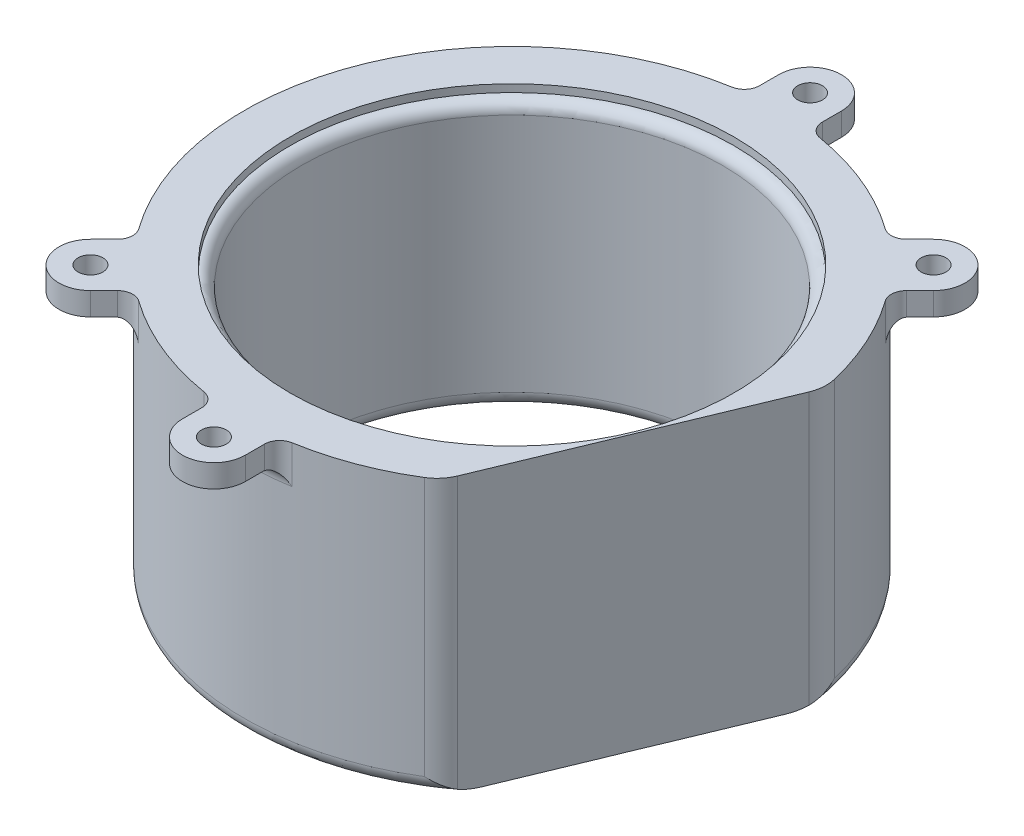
ISO-10303-21;
HEADER;
FILE_DESCRIPTION(('STEP AP214'),'2;1');
FILE_NAME('part.step','',(''),(''),'','','');
FILE_SCHEMA(('AUTOMOTIVE_DESIGN { 1 0 10303 214 1 1 1 1 }'));
ENDSEC;
DATA;
#1=APPLICATION_CONTEXT('core data for automotive mechanical design processes');
#2=APPLICATION_PROTOCOL_DEFINITION('international standard','automotive_design',2000,#1);
#3=PRODUCT_CONTEXT('',#1,'mechanical');
#4=PRODUCT('Part','Part','',(#3));
#5=PRODUCT_RELATED_PRODUCT_CATEGORY('part','',(#4));
#6=PRODUCT_DEFINITION_FORMATION('','',#4);
#7=PRODUCT_DEFINITION_CONTEXT('part definition',#1,'design');
#8=PRODUCT_DEFINITION('design','',#6,#7);
#9=PRODUCT_DEFINITION_SHAPE('','',#8);
#10=(LENGTH_UNIT() NAMED_UNIT(*) SI_UNIT(.MILLI.,.METRE.));
#11=(NAMED_UNIT(*) PLANE_ANGLE_UNIT() SI_UNIT($,.RADIAN.));
#12=(NAMED_UNIT(*) SI_UNIT($,.STERADIAN.) SOLID_ANGLE_UNIT());
#13=UNCERTAINTY_MEASURE_WITH_UNIT(LENGTH_MEASURE(1.E-05),#10,'distance_accuracy_value','');
#14=(GEOMETRIC_REPRESENTATION_CONTEXT(3) GLOBAL_UNCERTAINTY_ASSIGNED_CONTEXT((#13)) GLOBAL_UNIT_ASSIGNED_CONTEXT((#10,
#11,#12)) REPRESENTATION_CONTEXT('',''));
#15=CARTESIAN_POINT('',(0.,0.,0.));
#16=DIRECTION('',(0.,0.,1.));
#17=DIRECTION('',(1.,0.,0.));
#18=AXIS2_PLACEMENT_3D('',#15,#16,#17);
#19=CARTESIAN_POINT('',(0.,18.,0.));
#20=DIRECTION('',(0.,-1.,0.));
#21=DIRECTION('',(0.,0.,-1.));
#22=AXIS2_PLACEMENT_3D('',#19,#20,#21);
#23=CYLINDRICAL_SURFACE('',#22,35.125);
#24=CARTESIAN_POINT('',(0.,18.,0.));
#25=DIRECTION('',(0.,1.,0.));
#26=DIRECTION('',(0.,0.,1.));
#27=AXIS2_PLACEMENT_3D('',#24,#25,#26);
#28=CIRCLE('',#27,35.125);
#29=CARTESIAN_POINT('',(34.1722047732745,18.,-8.12564126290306));
#30=VERTEX_POINT('',#29);
#31=CARTESIAN_POINT('',(28.594474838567,18.,-20.3990596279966));
#32=VERTEX_POINT('',#31);
#33=EDGE_CURVE('E622',#30,#32,#28,.T.);
#34=ORIENTED_EDGE('',*,*,#33,.F.);
#35=DIRECTION('',(0.,-1.,0.));
#36=VECTOR('',#35,1.);
#37=CARTESIAN_POINT('',(34.1722047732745,18.,-8.12564126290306));
#38=LINE('',#37,#36);
#39=CARTESIAN_POINT('',(34.1722047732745,-16.,-8.12564126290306));
#40=VERTEX_POINT('',#39);
#41=EDGE_CURVE('E62',#30,#40,#38,.T.);
#42=ORIENTED_EDGE('',*,*,#41,.T.);
#43=CARTESIAN_POINT('',(0.,-16.,0.));
#44=DIRECTION('',(0.,1.,0.));
#45=DIRECTION('',(0.,0.,1.));
#46=AXIS2_PLACEMENT_3D('',#43,#44,#45);
#47=CIRCLE('',#46,35.125);
#48=CARTESIAN_POINT('',(18.4177016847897,-16.,29.9090937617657));
#49=VERTEX_POINT('',#48);
#50=EDGE_CURVE('E296',#40,#49,#47,.T.);
#51=ORIENTED_EDGE('',*,*,#50,.T.);
#52=DIRECTION('',(0.,-1.,0.));
#53=VECTOR('',#52,1.);
#54=CARTESIAN_POINT('',(18.4177016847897,18.,29.9090937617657));
#55=LINE('',#54,#53);
#56=CARTESIAN_POINT('',(18.4177016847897,18.,29.9090937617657));
#57=VERTEX_POINT('',#56);
#58=EDGE_CURVE('E835',#49,#57,#55,.F.);
#59=ORIENTED_EDGE('',*,*,#58,.T.);
#60=CARTESIAN_POINT('',(5.79503367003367,18.,34.6436604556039));
#61=VERTEX_POINT('',#60);
#62=EDGE_CURVE('E623',#61,#57,#28,.T.);
#63=ORIENTED_EDGE('',*,*,#62,.F.);
#64=DIRECTION('',(0.,-1.,0.));
#65=VECTOR('',#64,1.);
#66=CARTESIAN_POINT('',(5.79503367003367,18.,34.6436604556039));
#67=LINE('',#66,#65);
#68=CARTESIAN_POINT('',(5.79503367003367,13.,34.6436604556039));
#69=VERTEX_POINT('',#68);
#70=EDGE_CURVE('E312',#61,#69,#67,.T.);
#71=ORIENTED_EDGE('',*,*,#70,.T.);
#72=CARTESIAN_POINT('',(0.,13.,0.));
#73=DIRECTION('',(0.,1.,0.));
#74=DIRECTION('',(0.,0.,1.));
#75=AXIS2_PLACEMENT_3D('',#72,#73,#74);
#76=CIRCLE('',#75,35.125);
#77=CARTESIAN_POINT('',(-5.79503367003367,13.,34.6436604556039));
#78=VERTEX_POINT('',#77);
#79=EDGE_CURVE('E363',#69,#78,#76,.F.);
#80=ORIENTED_EDGE('',*,*,#79,.T.);
#81=DIRECTION('',(0.,-1.,0.));
#82=VECTOR('',#81,1.);
#83=CARTESIAN_POINT('',(-5.79503367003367,18.,34.6436604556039));
#84=LINE('',#83,#82);
#85=CARTESIAN_POINT('',(-5.79503367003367,18.,34.6436604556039));
#86=VERTEX_POINT('',#85);
#87=EDGE_CURVE('E309',#78,#86,#84,.F.);
#88=ORIENTED_EDGE('',*,*,#87,.T.);
#89=CARTESIAN_POINT('',(-20.3990596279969,18.,28.5944748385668));
#90=VERTEX_POINT('',#89);
#91=EDGE_CURVE('E626',#90,#86,#28,.T.);
#92=ORIENTED_EDGE('',*,*,#91,.F.);
#93=DIRECTION('',(0.,-1.,0.));
#94=VECTOR('',#93,1.);
#95=CARTESIAN_POINT('',(-20.3990596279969,18.,28.5944748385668));
#96=LINE('',#95,#94);
#97=CARTESIAN_POINT('',(-20.3990596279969,13.,28.5944748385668));
#98=VERTEX_POINT('',#97);
#99=EDGE_CURVE('E307',#90,#98,#96,.T.);
#100=ORIENTED_EDGE('',*,*,#99,.T.);
#101=CARTESIAN_POINT('',(0.,13.,0.));
#102=DIRECTION('',(0.,1.,0.));
#103=DIRECTION('',(0.,0.,1.));
#104=AXIS2_PLACEMENT_3D('',#101,#102,#103);
#105=CIRCLE('',#104,35.125);
#106=CARTESIAN_POINT('',(-28.5944748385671,13.,20.3990596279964));
#107=VERTEX_POINT('',#106);
#108=EDGE_CURVE('E366',#98,#107,#105,.F.);
#109=ORIENTED_EDGE('',*,*,#108,.T.);
#110=DIRECTION('',(0.,-1.,0.));
#111=VECTOR('',#110,1.);
#112=CARTESIAN_POINT('',(-28.5944748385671,18.,20.3990596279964));
#113=LINE('',#112,#111);
#114=CARTESIAN_POINT('',(-28.5944748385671,18.,20.3990596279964));
#115=VERTEX_POINT('',#114);
#116=EDGE_CURVE('E304',#107,#115,#113,.F.);
#117=ORIENTED_EDGE('',*,*,#116,.T.);
#118=CARTESIAN_POINT('',(-5.79503367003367,18.,-34.6436604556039));
#119=VERTEX_POINT('',#118);
#120=EDGE_CURVE('E290',#119,#115,#28,.T.);
#121=ORIENTED_EDGE('',*,*,#120,.F.);
#122=DIRECTION('',(0.,-1.,0.));
#123=VECTOR('',#122,1.);
#124=CARTESIAN_POINT('',(-5.79503367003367,18.,-34.6436604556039));
#125=LINE('',#124,#123);
#126=CARTESIAN_POINT('',(-5.79503367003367,13.,-34.6436604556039));
#127=VERTEX_POINT('',#126);
#128=EDGE_CURVE('E319',#119,#127,#125,.T.);
#129=ORIENTED_EDGE('',*,*,#128,.T.);
#130=CARTESIAN_POINT('',(0.,13.,0.));
#131=DIRECTION('',(0.,1.,0.));
#132=DIRECTION('',(0.,0.,1.));
#133=AXIS2_PLACEMENT_3D('',#130,#131,#132);
#134=CIRCLE('',#133,35.125);
#135=CARTESIAN_POINT('',(5.79503367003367,13.,-34.6436604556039));
#136=VERTEX_POINT('',#135);
#137=EDGE_CURVE('E360',#127,#136,#134,.F.);
#138=ORIENTED_EDGE('',*,*,#137,.T.);
#139=DIRECTION('',(0.,-1.,0.));
#140=VECTOR('',#139,1.);
#141=CARTESIAN_POINT('',(5.79503367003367,18.,-34.6436604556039));
#142=LINE('',#141,#140);
#143=CARTESIAN_POINT('',(5.79503367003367,18.,-34.6436604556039));
#144=VERTEX_POINT('',#143);
#145=EDGE_CURVE('E316',#136,#144,#142,.F.);
#146=ORIENTED_EDGE('',*,*,#145,.T.);
#147=CARTESIAN_POINT('',(20.3990596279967,18.,-28.5944748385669));
#148=VERTEX_POINT('',#147);
#149=EDGE_CURVE('E624',#148,#144,#28,.T.);
#150=ORIENTED_EDGE('',*,*,#149,.F.);
#151=DIRECTION('',(0.,-1.,0.));
#152=VECTOR('',#151,1.);
#153=CARTESIAN_POINT('',(20.3990596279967,18.,-28.5944748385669));
#154=LINE('',#153,#152);
#155=CARTESIAN_POINT('',(20.3990596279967,13.,-28.5944748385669));
#156=VERTEX_POINT('',#155);
#157=EDGE_CURVE('E314',#148,#156,#154,.T.);
#158=ORIENTED_EDGE('',*,*,#157,.T.);
#159=CARTESIAN_POINT('',(0.,13.,0.));
#160=DIRECTION('',(0.,1.,0.));
#161=DIRECTION('',(0.,0.,1.));
#162=AXIS2_PLACEMENT_3D('',#159,#160,#161);
#163=CIRCLE('',#162,35.125);
#164=CARTESIAN_POINT('',(28.594474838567,13.,-20.3990596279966));
#165=VERTEX_POINT('',#164);
#166=EDGE_CURVE('E357',#156,#165,#163,.F.);
#167=ORIENTED_EDGE('',*,*,#166,.T.);
#168=DIRECTION('',(0.,-1.,0.));
#169=VECTOR('',#168,1.);
#170=CARTESIAN_POINT('',(28.594474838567,18.,-20.3990596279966));
#171=LINE('',#170,#169);
#172=EDGE_CURVE('E301',#165,#32,#171,.F.);
#173=ORIENTED_EDGE('',*,*,#172,.T.);
#174=EDGE_LOOP('',(#34,#42,#51,#59,#63,#71,#80,#88,#92,#100,#109,#117,#121,#129,#138,#146,#150,
#158,#167,#173));
#175=FACE_BOUND('',#174,.T.);
#176=ADVANCED_FACE('F36',(#175),#23,.T.);
#177=CARTESIAN_POINT('',(0.,18.,0.));
#178=DIRECTION('',(0.,1.,0.));
#179=DIRECTION('',(0.,0.,1.));
#180=AXIS2_PLACEMENT_3D('',#177,#178,#179);
#181=PLANE('',#180);
#182=CARTESIAN_POINT('',(0.,18.,0.));
#183=DIRECTION('',(0.,1.,0.));
#184=DIRECTION('',(0.,0.,1.));
#185=AXIS2_PLACEMENT_3D('',#182,#183,#184);
#186=CIRCLE('',#185,29.125);
#187=CARTESIAN_POINT('',(0.,18.,29.125));
#188=VERTEX_POINT('',#187);
#189=EDGE_CURVE('E630',#188,#188,#186,.T.);
#190=ORIENTED_EDGE('',*,*,#189,.F.);
#191=EDGE_LOOP('',(#190));
#192=FACE_BOUND('',#191,.T.);
#193=CARTESIAN_POINT('',(0.,18.,-39.125));
#194=DIRECTION('',(0.,1.,0.));
#195=DIRECTION('',(0.,0.,1.));
#196=AXIS2_PLACEMENT_3D('',#193,#194,#195);
#197=CIRCLE('',#196,1.625);
#198=CARTESIAN_POINT('',(0.,18.,-37.5));
#199=VERTEX_POINT('',#198);
#200=EDGE_CURVE('E720',#199,#199,#197,.T.);
#201=ORIENTED_EDGE('',*,*,#200,.F.);
#202=EDGE_LOOP('',(#201));
#203=FACE_BOUND('',#202,.T.);
#204=CARTESIAN_POINT('',(27.6655528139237,18.,-27.6655528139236));
#205=DIRECTION('',(0.,1.,0.));
#206=DIRECTION('',(-0.707106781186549,0.,0.707106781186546));
#207=AXIS2_PLACEMENT_3D('',#204,#205,#206);
#208=CIRCLE('',#207,1.625);
#209=CARTESIAN_POINT('',(26.5165042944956,18.,-26.5165042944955));
#210=VERTEX_POINT('',#209);
#211=EDGE_CURVE('E692',#210,#210,#208,.T.);
#212=ORIENTED_EDGE('',*,*,#211,.F.);
#213=EDGE_LOOP('',(#212));
#214=FACE_BOUND('',#213,.T.);
#215=CARTESIAN_POINT('',(0.,18.,39.125));
#216=DIRECTION('',(0.,1.,0.));
#217=DIRECTION('',(0.,0.,-1.));
#218=AXIS2_PLACEMENT_3D('',#215,#216,#217);
#219=CIRCLE('',#218,1.625);
#220=CARTESIAN_POINT('',(0.,18.,37.5));
#221=VERTEX_POINT('',#220);
#222=EDGE_CURVE('E664',#221,#221,#219,.T.);
#223=ORIENTED_EDGE('',*,*,#222,.F.);
#224=EDGE_LOOP('',(#223));
#225=FACE_BOUND('',#224,.T.);
#226=CARTESIAN_POINT('',(-27.6655528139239,18.,27.6655528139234));
#227=DIRECTION('',(0.,1.,0.));
#228=DIRECTION('',(0.707106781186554,0.,-0.707106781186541));
#229=AXIS2_PLACEMENT_3D('',#226,#227,#228);
#230=CIRCLE('',#229,1.625);
#231=CARTESIAN_POINT('',(-26.5165042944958,18.,26.5165042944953));
#232=VERTEX_POINT('',#231);
#233=EDGE_CURVE('E652',#232,#232,#230,.T.);
#234=ORIENTED_EDGE('',*,*,#233,.F.);
#235=EDGE_LOOP('',(#234));
#236=FACE_BOUND('',#235,.T.);
#237=DIRECTION('',(0.382683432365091,0.,-0.923879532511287));
#238=VECTOR('',#237,1.);
#239=CARTESIAN_POINT('',(27.1712970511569,18.,11.2547197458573));
#240=LINE('',#239,#238);
#241=CARTESIAN_POINT('',(20.4153624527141,18.,27.5649886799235));
#242=VERTEX_POINT('',#241);
#243=CARTESIAN_POINT('',(33.9272316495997,18.,-5.05554918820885));
#244=VERTEX_POINT('',#243);
#245=EDGE_CURVE('E578',#242,#244,#240,.T.);
#246=ORIENTED_EDGE('',*,*,#245,.T.);
#247=CARTESIAN_POINT('',(29.3078339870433,18.,-6.9689663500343));
#248=DIRECTION('',(0.,1.,0.));
#249=DIRECTION('',(0.,0.,1.));
#250=AXIS2_PLACEMENT_3D('',#247,#248,#249);
#251=CIRCLE('',#250,5.);
#252=EDGE_CURVE('E615',#244,#30,#251,.T.);
#253=ORIENTED_EDGE('',*,*,#252,.T.);
#254=ORIENTED_EDGE('',*,*,#33,.T.);
#255=CARTESIAN_POINT('',(30.2226299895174,18.,-21.5605719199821));
#256=DIRECTION('',(0.,1.,0.));
#257=DIRECTION('',(0.,0.,1.));
#258=AXIS2_PLACEMENT_3D('',#255,#256,#257);
#259=CIRCLE('',#258,2.);
#260=CARTESIAN_POINT('',(28.8084164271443,18.,-22.9747854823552));
#261=VERTEX_POINT('',#260);
#262=EDGE_CURVE('E352',#32,#261,#259,.F.);
#263=ORIENTED_EDGE('',*,*,#262,.T.);
#264=DIRECTION('',(-0.707106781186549,0.,0.707106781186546));
#265=VECTOR('',#264,1.);
#266=CARTESIAN_POINT('',(2.9168154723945,18.,2.91681547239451));
#267=LINE('',#266,#265);
#268=CARTESIAN_POINT('',(30.5823682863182,18.,-24.7487373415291));
#269=VERTEX_POINT('',#268);
#270=EDGE_CURVE('E686',#269,#261,#267,.T.);
#271=ORIENTED_EDGE('',*,*,#270,.F.);
#272=CARTESIAN_POINT('',(27.6655528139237,18.,-27.6655528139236));
#273=DIRECTION('',(0.,1.,0.));
#274=DIRECTION('',(-0.707106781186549,0.,0.707106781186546));
#275=AXIS2_PLACEMENT_3D('',#272,#273,#274);
#276=CIRCLE('',#275,4.125);
#277=CARTESIAN_POINT('',(24.7487373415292,18.,-30.5823682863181));
#278=VERTEX_POINT('',#277);
#279=EDGE_CURVE('E704',#269,#278,#276,.T.);
#280=ORIENTED_EDGE('',*,*,#279,.T.);
#281=DIRECTION('',(-0.707106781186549,0.,0.707106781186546));
#282=VECTOR('',#281,1.);
#283=CARTESIAN_POINT('',(-2.9168154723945,18.,-2.91681547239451));
#284=LINE('',#283,#282);
#285=CARTESIAN_POINT('',(22.9747854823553,18.,-28.8084164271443));
#286=VERTEX_POINT('',#285);
#287=EDGE_CURVE('E707',#278,#286,#284,.T.);
#288=ORIENTED_EDGE('',*,*,#287,.T.);
#289=CARTESIAN_POINT('',(21.5605719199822,18.,-30.2226299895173));
#290=DIRECTION('',(0.,1.,0.));
#291=DIRECTION('',(0.,0.,1.));
#292=AXIS2_PLACEMENT_3D('',#289,#290,#291);
#293=CIRCLE('',#292,2.);
#294=EDGE_CURVE('E342',#286,#148,#293,.F.);
#295=ORIENTED_EDGE('',*,*,#294,.T.);
#296=ORIENTED_EDGE('',*,*,#149,.T.);
#297=CARTESIAN_POINT('',(6.125,18.,-36.6162532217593));
#298=DIRECTION('',(0.,1.,0.));
#299=DIRECTION('',(0.,0.,1.));
#300=AXIS2_PLACEMENT_3D('',#297,#298,#299);
#301=CIRCLE('',#300,2.);
#302=CARTESIAN_POINT('',(4.125,18.,-36.6162532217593));
#303=VERTEX_POINT('',#302);
#304=EDGE_CURVE('E340',#144,#303,#301,.F.);
#305=ORIENTED_EDGE('',*,*,#304,.T.);
#306=DIRECTION('',(0.,0.,1.));
#307=VECTOR('',#306,1.);
#308=CARTESIAN_POINT('',(4.125,18.,0.));
#309=LINE('',#308,#307);
#310=CARTESIAN_POINT('',(4.125,18.,-39.125));
#311=VERTEX_POINT('',#310);
#312=EDGE_CURVE('E714',#311,#303,#309,.T.);
#313=ORIENTED_EDGE('',*,*,#312,.F.);
#314=CARTESIAN_POINT('',(0.,18.,-39.125));
#315=DIRECTION('',(0.,1.,0.));
#316=DIRECTION('',(0.,0.,1.));
#317=AXIS2_PLACEMENT_3D('',#314,#315,#316);
#318=CIRCLE('',#317,4.125);
#319=CARTESIAN_POINT('',(-4.125,18.,-39.125));
#320=VERTEX_POINT('',#319);
#321=EDGE_CURVE('E732',#311,#320,#318,.T.);
#322=ORIENTED_EDGE('',*,*,#321,.T.);
#323=DIRECTION('',(0.,0.,1.));
#324=VECTOR('',#323,1.);
#325=CARTESIAN_POINT('',(-4.125,18.,0.));
#326=LINE('',#325,#324);
#327=CARTESIAN_POINT('',(-4.125,18.,-36.6162532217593));
#328=VERTEX_POINT('',#327);
#329=EDGE_CURVE('E735',#320,#328,#326,.T.);
#330=ORIENTED_EDGE('',*,*,#329,.T.);
#331=CARTESIAN_POINT('',(-6.125,18.,-36.6162532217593));
#332=DIRECTION('',(0.,1.,0.));
#333=DIRECTION('',(0.,0.,1.));
#334=AXIS2_PLACEMENT_3D('',#331,#332,#333);
#335=CIRCLE('',#334,2.);
#336=EDGE_CURVE('E338',#328,#119,#335,.F.);
#337=ORIENTED_EDGE('',*,*,#336,.T.);
#338=ORIENTED_EDGE('',*,*,#120,.T.);
#339=CARTESIAN_POINT('',(-30.2226299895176,18.,21.5605719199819));
#340=DIRECTION('',(0.,1.,0.));
#341=DIRECTION('',(0.,0.,1.));
#342=AXIS2_PLACEMENT_3D('',#339,#340,#341);
#343=CIRCLE('',#342,2.);
#344=CARTESIAN_POINT('',(-28.8084164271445,18.,22.974785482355));
#345=VERTEX_POINT('',#344);
#346=EDGE_CURVE('E350',#115,#345,#343,.F.);
#347=ORIENTED_EDGE('',*,*,#346,.T.);
#348=DIRECTION('',(0.707106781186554,0.,-0.707106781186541));
#349=VECTOR('',#348,1.);
#350=CARTESIAN_POINT('',(-2.91681547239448,18.,-2.91681547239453));
#351=LINE('',#350,#349);
#352=CARTESIAN_POINT('',(-30.5823682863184,18.,24.7487373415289));
#353=VERTEX_POINT('',#352);
#354=EDGE_CURVE('E636',#353,#345,#351,.T.);
#355=ORIENTED_EDGE('',*,*,#354,.F.);
#356=CARTESIAN_POINT('',(-27.6655528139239,18.,27.6655528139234));
#357=DIRECTION('',(0.,1.,0.));
#358=DIRECTION('',(0.707106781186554,0.,-0.707106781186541));
#359=AXIS2_PLACEMENT_3D('',#356,#357,#358);
#360=CIRCLE('',#359,4.125);
#361=CARTESIAN_POINT('',(-24.7487373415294,18.,30.582368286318));
#362=VERTEX_POINT('',#361);
#363=EDGE_CURVE('E639',#353,#362,#360,.T.);
#364=ORIENTED_EDGE('',*,*,#363,.T.);
#365=DIRECTION('',(0.707106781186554,0.,-0.707106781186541));
#366=VECTOR('',#365,1.);
#367=CARTESIAN_POINT('',(2.91681547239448,18.,2.91681547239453));
#368=LINE('',#367,#366);
#369=CARTESIAN_POINT('',(-22.9747854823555,18.,28.8084164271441));
#370=VERTEX_POINT('',#369);
#371=EDGE_CURVE('E644',#362,#370,#368,.T.);
#372=ORIENTED_EDGE('',*,*,#371,.T.);
#373=CARTESIAN_POINT('',(-21.5605719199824,18.,30.2226299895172));
#374=DIRECTION('',(0.,1.,0.));
#375=DIRECTION('',(0.,0.,1.));
#376=AXIS2_PLACEMENT_3D('',#373,#374,#375);
#377=CIRCLE('',#376,2.);
#378=EDGE_CURVE('E348',#370,#90,#377,.F.);
#379=ORIENTED_EDGE('',*,*,#378,.T.);
#380=ORIENTED_EDGE('',*,*,#91,.T.);
#381=CARTESIAN_POINT('',(-6.125,18.,36.6162532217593));
#382=DIRECTION('',(0.,1.,0.));
#383=DIRECTION('',(0.,0.,1.));
#384=AXIS2_PLACEMENT_3D('',#381,#382,#383);
#385=CIRCLE('',#384,2.);
#386=CARTESIAN_POINT('',(-4.125,18.,36.6162532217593));
#387=VERTEX_POINT('',#386);
#388=EDGE_CURVE('E346',#86,#387,#385,.F.);
#389=ORIENTED_EDGE('',*,*,#388,.T.);
#390=DIRECTION('',(0.,0.,-1.));
#391=VECTOR('',#390,1.);
#392=CARTESIAN_POINT('',(-4.125,18.,0.));
#393=LINE('',#392,#391);
#394=CARTESIAN_POINT('',(-4.125,18.,39.125));
#395=VERTEX_POINT('',#394);
#396=EDGE_CURVE('E657',#395,#387,#393,.T.);
#397=ORIENTED_EDGE('',*,*,#396,.F.);
#398=CARTESIAN_POINT('',(0.,18.,39.125));
#399=DIRECTION('',(0.,1.,0.));
#400=DIRECTION('',(0.,0.,-1.));
#401=AXIS2_PLACEMENT_3D('',#398,#399,#400);
#402=CIRCLE('',#401,4.125);
#403=CARTESIAN_POINT('',(4.125,18.,39.125));
#404=VERTEX_POINT('',#403);
#405=EDGE_CURVE('E676',#395,#404,#402,.T.);
#406=ORIENTED_EDGE('',*,*,#405,.T.);
#407=DIRECTION('',(0.,0.,-1.));
#408=VECTOR('',#407,1.);
#409=CARTESIAN_POINT('',(4.125,18.,0.));
#410=LINE('',#409,#408);
#411=CARTESIAN_POINT('',(4.125,18.,36.6162532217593));
#412=VERTEX_POINT('',#411);
#413=EDGE_CURVE('E679',#404,#412,#410,.T.);
#414=ORIENTED_EDGE('',*,*,#413,.T.);
#415=CARTESIAN_POINT('',(6.125,18.,36.6162532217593));
#416=DIRECTION('',(0.,1.,0.));
#417=DIRECTION('',(0.,0.,1.));
#418=AXIS2_PLACEMENT_3D('',#415,#416,#417);
#419=CIRCLE('',#418,2.);
#420=EDGE_CURVE('E344',#412,#61,#419,.F.);
#421=ORIENTED_EDGE('',*,*,#420,.T.);
#422=ORIENTED_EDGE('',*,*,#62,.T.);
#423=CARTESIAN_POINT('',(15.7959647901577,18.,25.651571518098));
#424=DIRECTION('',(0.,1.,0.));
#425=DIRECTION('',(0.,0.,1.));
#426=AXIS2_PLACEMENT_3D('',#423,#424,#425);
#427=CIRCLE('',#426,5.);
#428=EDGE_CURVE('E616',#57,#242,#427,.T.);
#429=ORIENTED_EDGE('',*,*,#428,.T.);
#430=EDGE_LOOP('',(#246,#253,#254,#263,#271,#280,#288,#295,#296,#305,#313,#322,#330,#337,#338,
#347,#355,#364,#372,#379,#380,#389,#397,#406,#414,#421,#422,#429));
#431=FACE_BOUND('',#430,.T.);
#432=ADVANCED_FACE('F591',(#192,#203,#214,#225,#236,#431),#181,.T.);
#433=CARTESIAN_POINT('',(0.,-18.,0.));
#434=DIRECTION('',(0.,1.,0.));
#435=DIRECTION('',(0.,0.,1.));
#436=AXIS2_PLACEMENT_3D('',#433,#434,#435);
#437=PLANE('',#436);
#438=DIRECTION('',(0.382683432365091,0.,-0.923879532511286));
#439=VECTOR('',#438,1.);
#440=CARTESIAN_POINT('',(27.1712970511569,-18.,11.2547197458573));
#441=LINE('',#440,#439);
#442=CARTESIAN_POINT('',(21.3384492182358,-18.,25.3364600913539));
#443=VERTEX_POINT('',#442);
#444=CARTESIAN_POINT('',(25.8079272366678,-18.,14.546185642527));
#445=VERTEX_POINT('',#444);
#446=EDGE_CURVE('E264',#443,#445,#441,.T.);
#447=ORIENTED_EDGE('',*,*,#446,.F.);
#448=CARTESIAN_POINT('',(0.,-18.,0.));
#449=DIRECTION('',(0.,1.,0.));
#450=DIRECTION('',(0.,0.,1.));
#451=AXIS2_PLACEMENT_3D('',#448,#449,#450);
#452=CIRCLE('',#451,33.125);
#453=CARTESIAN_POINT('',(33.004144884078,-18.,-2.8270205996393));
#454=VERTEX_POINT('',#453);
#455=EDGE_CURVE('E277',#443,#454,#452,.F.);
#456=ORIENTED_EDGE('',*,*,#455,.T.);
#457=CARTESIAN_POINT('',(28.5346668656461,-18.,7.96325384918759));
#458=VERTEX_POINT('',#457);
#459=EDGE_CURVE('E281',#458,#454,#441,.T.);
#460=ORIENTED_EDGE('',*,*,#459,.F.);
#461=CARTESIAN_POINT('',(0.,-18.,0.));
#462=DIRECTION('',(0.,1.,0.));
#463=DIRECTION('',(0.,0.,1.));
#464=AXIS2_PLACEMENT_3D('',#461,#462,#463);
#465=CIRCLE('',#464,29.625);
#466=EDGE_CURVE('E279',#458,#445,#465,.T.);
#467=ORIENTED_EDGE('',*,*,#466,.T.);
#468=EDGE_LOOP('',(#447,#456,#460,#467));
#469=FACE_BOUND('',#468,.T.);
#470=ADVANCED_FACE('F275',(#469),#437,.F.);
#471=CARTESIAN_POINT('',(0.,-16.,0.));
#472=DIRECTION('',(0.,1.,0.));
#473=DIRECTION('',(0.,0.,1.));
#474=AXIS2_PLACEMENT_3D('',#471,#472,#473);
#475=TOROIDAL_SURFACE('',#474,29.625,2.);
#476=CARTESIAN_POINT('',(0.,-16.,0.));
#477=DIRECTION('',(0.,1.,0.));
#478=DIRECTION('',(0.,0.,1.));
#479=AXIS2_PLACEMENT_3D('',#476,#477,#478);
#480=CIRCLE('',#479,27.625);
#481=CARTESIAN_POINT('',(0.,-16.,27.625));
#482=VERTEX_POINT('',#481);
#483=EDGE_CURVE('E287',#482,#482,#480,.F.);
#484=ORIENTED_EDGE('',*,*,#483,.F.);
#485=EDGE_LOOP('',(#484));
#486=FACE_BOUND('',#485,.T.);
#487=ORIENTED_EDGE('',*,*,#466,.F.);
#488=CARTESIAN_POINT('',(29.6252,-17.9425456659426,5.33047396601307));
#489=CARTESIAN_POINT('',(29.5614302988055,-17.9512316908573,5.4844276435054));
#490=CARTESIAN_POINT('',(29.4976366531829,-17.9585888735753,5.63843912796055));
#491=CARTESIAN_POINT('',(29.3700214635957,-17.9710843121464,5.94652944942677));
#492=CARTESIAN_POINT('',(29.3061999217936,-17.97622271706,6.10060828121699));
#493=CARTESIAN_POINT('',(29.1785554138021,-17.9847194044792,6.40876938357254));
#494=CARTESIAN_POINT('',(29.1147324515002,-17.9880781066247,6.56285164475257));
#495=CARTESIAN_POINT('',(28.9870770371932,-17.993385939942,6.87103907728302));
#496=CARTESIAN_POINT('',(28.9232445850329,-17.9953350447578,7.02514424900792));
#497=CARTESIAN_POINT('',(28.7317605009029,-17.9995770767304,7.48742772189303));
#498=CARTESIAN_POINT('',(28.6041041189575,-18.0002657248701,7.79561749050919));
#499=CARTESIAN_POINT('',(28.348785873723,-17.9995738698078,8.41201026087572));
#500=CARTESIAN_POINT('',(28.2211240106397,-17.9981932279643,8.72021326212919));
#501=CARTESIAN_POINT('',(27.9451872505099,-17.9947654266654,9.38638353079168));
#502=CARTESIAN_POINT('',(27.7969124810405,-17.9926466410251,9.74435049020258));
#503=CARTESIAN_POINT('',(27.5003649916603,-17.9895362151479,10.4602794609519));
#504=CARTESIAN_POINT('',(27.3520922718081,-17.9885445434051,10.818241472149));
#505=CARTESIAN_POINT('',(27.0555449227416,-17.9883023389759,11.5341701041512));
#506=CARTESIAN_POINT('',(26.9072702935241,-17.98905182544,11.8921367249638));
#507=CARTESIAN_POINT('',(26.6107218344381,-17.9918369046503,12.6080680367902));
#508=CARTESIAN_POINT('',(26.4624480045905,-17.9938725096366,12.9660327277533));
#509=CARTESIAN_POINT('',(26.2151836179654,-17.9970554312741,13.5629817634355));
#510=CARTESIAN_POINT('',(26.1161932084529,-17.9982731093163,13.8019657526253));
#511=CARTESIAN_POINT('',(25.918211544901,-17.9998793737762,14.2799357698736));
#512=CARTESIAN_POINT('',(25.8192202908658,-18.0002679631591,14.5189217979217));
#513=CARTESIAN_POINT('',(25.6212264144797,-17.9993277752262,14.9969212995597));
#514=CARTESIAN_POINT('',(25.5222237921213,-17.9979988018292,15.235934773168));
#515=CARTESIAN_POINT('',(25.3242319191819,-17.9925191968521,15.713929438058));
#516=CARTESIAN_POINT('',(25.2252426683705,-17.9883686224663,15.9529106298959));
#517=CARTESIAN_POINT('',(24.9925412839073,-17.9737629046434,16.51470146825));
#518=CARTESIAN_POINT('',(24.858841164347,-17.9616058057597,16.8374821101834));
#519=CARTESIAN_POINT('',(24.658482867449,-17.9346163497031,17.3211898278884));
#520=CARTESIAN_POINT('',(24.5917392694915,-17.9241632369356,17.4823231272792));
#521=CARTESIAN_POINT('',(24.4583494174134,-17.8996703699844,17.8043547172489));
#522=CARTESIAN_POINT('',(24.3917031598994,-17.88563074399,17.9652530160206));
#523=CARTESIAN_POINT('',(24.2333254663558,-17.8470537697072,18.3476105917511));
#524=CARTESIAN_POINT('',(24.1416617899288,-17.8205544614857,18.5689062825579));
#525=CARTESIAN_POINT('',(23.9587868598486,-17.7566787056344,19.0104054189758));
#526=CARTESIAN_POINT('',(23.8675760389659,-17.7192933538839,19.2306078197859));
#527=CARTESIAN_POINT('',(23.7301445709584,-17.6515660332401,19.5623967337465));
#528=CARTESIAN_POINT('',(23.6835369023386,-17.6265873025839,19.674917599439));
#529=CARTESIAN_POINT('',(23.5907205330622,-17.5720276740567,19.8989961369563));
#530=CARTESIAN_POINT('',(23.5445117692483,-17.5424475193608,20.0105539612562));
#531=CARTESIAN_POINT('',(23.4527052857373,-17.4778222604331,20.2321944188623));
#532=CARTESIAN_POINT('',(23.4071069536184,-17.4427831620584,20.3422785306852));
#533=CARTESIAN_POINT('',(23.3167493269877,-17.366032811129,20.5604211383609));
#534=CARTESIAN_POINT('',(23.2719896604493,-17.3243245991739,20.6684805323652));
#535=CARTESIAN_POINT('',(23.1837280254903,-17.2325783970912,20.8815629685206));
#536=CARTESIAN_POINT('',(23.1402258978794,-17.1825414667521,20.9865863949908));
#537=CARTESIAN_POINT('',(23.0551793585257,-17.0716956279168,21.1919069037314));
#538=CARTESIAN_POINT('',(23.0136358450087,-17.0108818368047,21.2922018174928));
#539=CARTESIAN_POINT('',(22.944273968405,-16.8923997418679,21.4596562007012));
#540=CARTESIAN_POINT('',(22.9156670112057,-16.837920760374,21.5287195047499));
#541=CARTESIAN_POINT('',(22.8616265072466,-16.7190643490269,21.6591848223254));
#542=CARTESIAN_POINT('',(22.8361836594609,-16.6547172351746,21.720609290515));
#543=CARTESIAN_POINT('',(22.8005832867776,-16.544750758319,21.8065561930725));
#544=CARTESIAN_POINT('',(22.7885982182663,-16.5031997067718,21.8354907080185));
#545=CARTESIAN_POINT('',(22.766953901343,-16.4160901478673,21.8877447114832));
#546=CARTESIAN_POINT('',(22.7572929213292,-16.3705346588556,21.9110683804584));
#547=CARTESIAN_POINT('',(22.7422012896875,-16.2824535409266,21.9475028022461));
#548=CARTESIAN_POINT('',(22.7363660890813,-16.2404073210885,21.9615902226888));
#549=CARTESIAN_POINT('',(22.7274797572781,-16.1543983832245,21.9830437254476));
#550=CARTESIAN_POINT('',(22.7244213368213,-16.1104410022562,21.990427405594));
#551=CARTESIAN_POINT('',(22.7221229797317,-16.0440919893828,21.9959761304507));
#552=CARTESIAN_POINT('',(22.721737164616,-16.0219437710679,21.9969075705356));
#553=CARTESIAN_POINT('',(22.7217479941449,-15.9998,21.9968814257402));
#554=B_SPLINE_CURVE_WITH_KNOTS('',3,(#488,#489,#490,#491,#492,#493,#494,#495,#496,#497,#498,
#499,#500,#501,#502,#503,#504,#505,#506,#507,#508,#509,#510,#511,#512,#513,#514,#515,#516,#517,
#518,#519,#520,#521,#522,#523,#524,#525,#526,#527,#528,#529,#530,#531,#532,#533,#534,#535,#536,
#537,#538,#539,#540,#541,#542,#543,#544,#545,#546,#547,#548,#549,#550,#551,#552,#553),
.UNSPECIFIED.,.F.,.F.,(4,2,2,2,2,2,2,2,2,2,2,2,2,2,2,2,2,2,2,2,2,2,2,2,2,2,2,2,2,2,2,2,4),(0.,
0.500578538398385,1.00112344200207,1.50155026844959,2.00198645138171,3.00271751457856,
4.00351562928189,5.16591467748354,6.32828123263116,7.49066057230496,8.65305097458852,
9.42908244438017,10.2051111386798,10.9812284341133,11.7573299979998,12.8059362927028,
13.3300739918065,13.8541929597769,14.5769923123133,15.3003845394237,15.6732954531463,
16.0461462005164,16.4185896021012,16.790863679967,17.1630904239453,17.5354862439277,
17.8124280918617,18.0885355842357,18.2442492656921,18.3998465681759,18.5334899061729,
18.6667813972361,18.7332079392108),.UNSPECIFIED.);
#555=EDGE_CURVE('E280',#458,#445,#554,.T.);
#556=ORIENTED_EDGE('',*,*,#555,.T.);
#557=EDGE_LOOP('',(#487,#556));
#558=FACE_BOUND('',#557,.T.);
#559=ADVANCED_FACE('F581',(#486,#558),#475,.T.);
#560=CARTESIAN_POINT('',(0.,-16.,0.));
#561=DIRECTION('',(0.,1.,0.));
#562=DIRECTION('',(0.,0.,1.));
#563=AXIS2_PLACEMENT_3D('',#560,#561,#562);
#564=TOROIDAL_SURFACE('',#563,33.125,2.);
#565=ORIENTED_EDGE('',*,*,#50,.F.);
#566=CARTESIAN_POINT('',(33.9272316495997,-17.6171172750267,-5.05554918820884));
#567=CARTESIAN_POINT('',(33.9798358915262,-17.5655814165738,-5.18257019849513));
#568=CARTESIAN_POINT('',(34.0266913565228,-17.5106410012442,-5.31048169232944));
#569=CARTESIAN_POINT('',(34.1092330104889,-17.3952647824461,-5.56726829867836));
#570=CARTESIAN_POINT('',(34.1449306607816,-17.3348347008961,-5.6961422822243));
#571=CARTESIAN_POINT('',(34.2055420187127,-17.2097842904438,-5.95408908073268));
#572=CARTESIAN_POINT('',(34.230473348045,-17.1451710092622,-6.08316122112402));
#573=CARTESIAN_POINT('',(34.2699841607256,-17.0126135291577,-6.34118769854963));
#574=CARTESIAN_POINT('',(34.2845609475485,-16.944668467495,-6.4701419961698));
#575=CARTESIAN_POINT('',(34.3131974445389,-16.7372231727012,-6.85585736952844));
#576=CARTESIAN_POINT('',(34.3122405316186,-16.59394559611,-7.11180917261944));
#577=CARTESIAN_POINT('',(34.2720519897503,-16.3029714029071,-7.61765674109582));
#578=CARTESIAN_POINT('',(34.2328724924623,-16.1552810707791,-7.86756027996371));
#579=CARTESIAN_POINT('',(34.1742313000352,-16.0051451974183,-8.11709371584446));
#580=CARTESIAN_POINT('',(34.1732208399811,-16.0025725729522,-8.12136820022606));
#581=CARTESIAN_POINT('',(34.1722047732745,-16.,-8.12564126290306));
#582=B_SPLINE_CURVE_WITH_KNOTS('',3,(#566,#567,#568,#569,#570,#571,#572,#573,#574,#575,#576,
#577,#578,#579,#580,#581),.UNSPECIFIED.,.F.,.F.,(4,2,2,2,2,2,2,4),(0.,0.4401820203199,
0.879910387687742,1.31891627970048,1.7580364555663,2.63513219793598,3.5110333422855,
3.52630407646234),.UNSPECIFIED.);
#583=CARTESIAN_POINT('',(33.9272316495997,-17.6171172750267,-5.05554918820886));
#584=VERTEX_POINT('',#583);
#585=EDGE_CURVE('E11',#40,#584,#582,.F.);
#586=ORIENTED_EDGE('',*,*,#585,.T.);
#587=CARTESIAN_POINT('',(34.520587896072,-15.9998,-6.48803788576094));
#588=CARTESIAN_POINT('',(34.5205927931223,-16.0324384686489,-6.4880497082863));
#589=CARTESIAN_POINT('',(34.5200327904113,-16.0650592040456,-6.48669774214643));
#590=CARTESIAN_POINT('',(34.5178112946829,-16.1300185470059,-6.48133457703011));
#591=CARTESIAN_POINT('',(34.5161506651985,-16.1623573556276,-6.47732546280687));
#592=CARTESIAN_POINT('',(34.5095987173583,-16.2580764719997,-6.46150766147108));
#593=CARTESIAN_POINT('',(34.503136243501,-16.320758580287,-6.44590586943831));
#594=CARTESIAN_POINT('',(34.4865462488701,-16.4424170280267,-6.4058540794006));
#595=CARTESIAN_POINT('',(34.4764291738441,-16.50140337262,-6.38142929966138));
#596=CARTESIAN_POINT('',(34.4531498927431,-16.6152179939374,-6.32522814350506));
#597=CARTESIAN_POINT('',(34.4399809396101,-16.6700366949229,-6.29343547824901));
#598=CARTESIAN_POINT('',(34.4017178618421,-16.8098494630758,-6.20106023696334));
#599=CARTESIAN_POINT('',(34.3744928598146,-16.8908544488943,-6.13533326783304));
#600=CARTESIAN_POINT('',(34.3155835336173,-17.040922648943,-5.99311357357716));
#601=CARTESIAN_POINT('',(34.2838866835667,-17.1099510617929,-5.91659060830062));
#602=CARTESIAN_POINT('',(34.2227586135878,-17.2272958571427,-5.76901439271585));
#603=CARTESIAN_POINT('',(34.1937548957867,-17.277162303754,-5.69899322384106));
#604=CARTESIAN_POINT('',(34.1341996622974,-17.3701923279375,-5.55521417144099));
#605=CARTESIAN_POINT('',(34.103647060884,-17.4133511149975,-5.48145366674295));
#606=CARTESIAN_POINT('',(34.0413927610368,-17.4937235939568,-5.33115849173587));
#607=CARTESIAN_POINT('',(34.0096900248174,-17.530931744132,-5.25462131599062));
#608=CARTESIAN_POINT('',(33.9454390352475,-17.6000107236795,-5.09950570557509));
#609=CARTESIAN_POINT('',(33.9128904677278,-17.6318795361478,-5.02092651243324));
#610=CARTESIAN_POINT('',(33.8185792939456,-17.7164651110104,-4.79323919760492));
#611=CARTESIAN_POINT('',(33.7560278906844,-17.763208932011,-4.64222675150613));
#612=CARTESIAN_POINT('',(33.6296266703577,-17.842713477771,-4.33706721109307));
#613=CARTESIAN_POINT('',(33.5657757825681,-17.8754621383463,-4.18291753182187));
#614=CARTESIAN_POINT('',(33.4371390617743,-17.9289835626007,-3.87236101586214));
#615=CARTESIAN_POINT('',(33.372350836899,-17.9497164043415,-3.71594840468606));
#616=CARTESIAN_POINT('',(33.242393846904,-17.9804878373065,-3.40220447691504));
#617=CARTESIAN_POINT('',(33.1772249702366,-17.99052311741,-3.24487289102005));
#618=CARTESIAN_POINT('',(33.057492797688,-18.0000807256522,-2.95581385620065));
#619=CARTESIAN_POINT('',(33.0029449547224,-18.0010585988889,-2.82412371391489));
#620=CARTESIAN_POINT('',(32.8938809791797,-17.996712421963,-2.56081998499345));
#621=CARTESIAN_POINT('',(32.8393648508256,-17.9913876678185,-2.42920640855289));
#622=CARTESIAN_POINT('',(32.7304171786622,-17.9747490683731,-2.16618346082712));
#623=CARTESIAN_POINT('',(32.6759857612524,-17.9634296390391,-2.03477439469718));
#624=CARTESIAN_POINT('',(32.5673446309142,-17.9350009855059,-1.77249150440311));
#625=CARTESIAN_POINT('',(32.5131349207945,-17.9178916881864,-1.64161768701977));
#626=CARTESIAN_POINT('',(32.4052365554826,-17.8780453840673,-1.38112799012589));
#627=CARTESIAN_POINT('',(32.3515466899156,-17.8553307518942,-1.25150918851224));
#628=CARTESIAN_POINT('',(32.2445713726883,-17.8041950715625,-0.993247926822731));
#629=CARTESIAN_POINT('',(32.1912858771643,-17.775774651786,-0.864605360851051));
#630=CARTESIAN_POINT('',(32.0852823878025,-17.713052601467,-0.608690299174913));
#631=CARTESIAN_POINT('',(32.0325638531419,-17.6787572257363,-0.481416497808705));
#632=CARTESIAN_POINT('',(31.9277944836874,-17.603858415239,-0.228480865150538));
#633=CARTESIAN_POINT('',(31.8757434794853,-17.5632566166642,-0.102818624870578));
#634=CARTESIAN_POINT('',(31.7993580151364,-17.4979516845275,0.081592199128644));
#635=CARTESIAN_POINT('',(31.774682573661,-17.4759570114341,0.141163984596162));
#636=CARTESIAN_POINT('',(31.7255725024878,-17.4302192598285,0.25972618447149));
#637=CARTESIAN_POINT('',(31.7011378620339,-17.4064762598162,0.318716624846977));
#638=CARTESIAN_POINT('',(31.6281670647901,-17.3323329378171,0.494883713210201));
#639=CARTESIAN_POINT('',(31.5800411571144,-17.2790831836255,0.611069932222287));
#640=CARTESIAN_POINT('',(31.5065282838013,-17.1890394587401,0.788545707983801));
#641=CARTESIAN_POINT('',(31.4805591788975,-17.1554775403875,0.851240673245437));
#642=CARTESIAN_POINT('',(31.4292972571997,-17.085008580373,0.974997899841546));
#643=CARTESIAN_POINT('',(31.4040042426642,-17.0481025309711,1.03606063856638));
#644=CARTESIAN_POINT('',(31.3543987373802,-16.9704356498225,1.15581892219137));
#645=CARTESIAN_POINT('',(31.3300834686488,-16.9296870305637,1.21452117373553));
#646=CARTESIAN_POINT('',(31.2827401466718,-16.8434137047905,1.32881806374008));
#647=CARTESIAN_POINT('',(31.2597107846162,-16.7978939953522,1.38441586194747));
#648=CARTESIAN_POINT('',(31.2203023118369,-16.7113032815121,1.47955633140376));
#649=CARTESIAN_POINT('',(31.2035577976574,-16.6713793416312,1.51998116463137));
#650=CARTESIAN_POINT('',(31.1717155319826,-16.5870052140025,1.59685519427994));
#651=CARTESIAN_POINT('',(31.1566216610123,-16.5425448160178,1.63329502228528));
#652=CARTESIAN_POINT('',(31.1287079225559,-16.4476403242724,1.70068474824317));
#653=CARTESIAN_POINT('',(31.1159315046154,-16.3971066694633,1.73152974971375));
#654=CARTESIAN_POINT('',(31.0944147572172,-16.2906489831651,1.78347577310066));
#655=CARTESIAN_POINT('',(31.0856440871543,-16.2347694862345,1.80465004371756));
#656=CARTESIAN_POINT('',(31.0766737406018,-16.148218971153,1.82630637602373));
#657=CARTESIAN_POINT('',(31.0743819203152,-16.1190070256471,1.83183931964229));
#658=CARTESIAN_POINT('',(31.0712767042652,-16.0598159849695,1.83933597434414));
#659=CARTESIAN_POINT('',(31.0704754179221,-16.0298325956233,1.84127045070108));
#660=CARTESIAN_POINT('',(31.0704924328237,-15.9998,1.841229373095));
#661=B_SPLINE_CURVE_WITH_KNOTS('',3,(#587,#588,#589,#590,#591,#592,#593,#594,#595,#596,#597,
#598,#599,#600,#601,#602,#603,#604,#605,#606,#607,#608,#609,#610,#611,#612,#613,#614,#615,#616,
#617,#618,#619,#620,#621,#622,#623,#624,#625,#626,#627,#628,#629,#630,#631,#632,#633,#634,#635,
#636,#637,#638,#639,#640,#641,#642,#643,#644,#645,#646,#647,#648,#649,#650,#651,#652,#653,#654,
#655,#656,#657,#658,#659,#660),.UNSPECIFIED.,.F.,.F.,(4,2,2,2,2,2,2,2,2,2,2,2,2,2,2,2,2,2,2,2,2,
2,2,2,2,2,2,2,2,2,2,2,2,2,2,2,4),(0.,0.0978485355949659,0.195620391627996,0.38939175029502,
0.582613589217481,0.776266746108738,1.09784931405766,1.42035122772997,1.69214027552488,
1.96412254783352,2.23635665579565,2.50869336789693,3.0178776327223,3.5274999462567,
4.0388058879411,4.55027004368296,4.97775986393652,5.40529743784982,5.83323396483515,
6.2611758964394,6.68743650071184,7.11365018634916,7.53941288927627,7.96506531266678,
8.16942634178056,8.37377820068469,8.78311631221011,9.01016548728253,9.23714751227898,
9.46343100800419,9.6894798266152,9.86693730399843,10.0448033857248,10.2257205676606,
10.4052437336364,10.4944614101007,10.5844007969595),.UNSPECIFIED.);
#662=EDGE_CURVE('E270',#584,#454,#661,.T.);
#663=ORIENTED_EDGE('',*,*,#662,.T.);
#664=ORIENTED_EDGE('',*,*,#455,.F.);
#665=CARTESIAN_POINT('',(23.2721016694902,-15.9998,20.6682101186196));
#666=CARTESIAN_POINT('',(23.2721077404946,-16.0213208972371,20.6681954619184));
#667=CARTESIAN_POINT('',(23.2717003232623,-16.0428277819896,20.6691790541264));
#668=CARTESIAN_POINT('',(23.2700924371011,-16.0856047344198,20.6730608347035));
#669=CARTESIAN_POINT('',(23.2688932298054,-16.1068751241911,20.6759559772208));
#670=CARTESIAN_POINT('',(23.2642047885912,-16.1694791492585,20.6872748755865));
#671=CARTESIAN_POINT('',(23.2596225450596,-16.2102714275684,20.6983373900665));
#672=CARTESIAN_POINT('',(23.2464776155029,-16.3000011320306,20.7300720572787));
#673=CARTESIAN_POINT('',(23.2371756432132,-16.3481767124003,20.7525290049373));
#674=CARTESIAN_POINT('',(23.2157571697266,-16.4403073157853,20.8042377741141));
#675=CARTESIAN_POINT('',(23.2036228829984,-16.4842330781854,20.833532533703));
#676=CARTESIAN_POINT('',(23.1788471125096,-16.5634149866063,20.8933465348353));
#677=CARTESIAN_POINT('',(23.1663998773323,-16.5990956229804,20.9233968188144));
#678=CARTESIAN_POINT('',(23.1403818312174,-16.6675629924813,20.9862099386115));
#679=CARTESIAN_POINT('',(23.1268100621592,-16.7003472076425,21.0189750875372));
#680=CARTESIAN_POINT('',(23.0848388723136,-16.7949907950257,21.1203025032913));
#681=CARTESIAN_POINT('',(23.055200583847,-16.8530907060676,21.1918556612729));
#682=CARTESIAN_POINT('',(23.0022031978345,-16.9471103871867,21.3198026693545));
#683=CARTESIAN_POINT('',(22.9792859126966,-16.984805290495,21.3751298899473));
#684=CARTESIAN_POINT('',(22.932675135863,-17.0567823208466,21.4876582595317));
#685=CARTESIAN_POINT('',(22.9089815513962,-17.0910640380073,21.5448596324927));
#686=CARTESIAN_POINT('',(22.8369562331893,-17.1896831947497,21.718744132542));
#687=CARTESIAN_POINT('',(22.7877540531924,-17.2496692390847,21.8375287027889));
#688=CARTESIAN_POINT('',(22.6876334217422,-17.3609843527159,22.0792412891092));
#689=CARTESIAN_POINT('',(22.6367066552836,-17.4122610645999,22.2021893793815));
#690=CARTESIAN_POINT('',(22.533881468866,-17.5072189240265,22.4504313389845));
#691=CARTESIAN_POINT('',(22.4819839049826,-17.5509064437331,22.5757231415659));
#692=CARTESIAN_POINT('',(22.3777251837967,-17.631436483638,22.8274259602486));
#693=CARTESIAN_POINT('',(22.325367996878,-17.66831440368,22.9538273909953));
#694=CARTESIAN_POINT('',(22.2200795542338,-17.7360473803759,23.2080161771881));
#695=CARTESIAN_POINT('',(22.1671482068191,-17.7669014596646,23.3358037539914));
#696=CARTESIAN_POINT('',(22.0607890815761,-17.8228952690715,23.5925773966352));
#697=CARTESIAN_POINT('',(22.007360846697,-17.848029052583,23.721564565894));
#698=CARTESIAN_POINT('',(21.9001537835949,-17.8926556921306,23.9803853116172));
#699=CARTESIAN_POINT('',(21.8463749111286,-17.9121478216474,24.1102189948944));
#700=CARTESIAN_POINT('',(21.7388733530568,-17.9453622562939,24.3697507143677));
#701=CARTESIAN_POINT('',(21.6851521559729,-17.9591174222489,24.4994451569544));
#702=CARTESIAN_POINT('',(21.5775396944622,-17.9808744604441,24.7592446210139));
#703=CARTESIAN_POINT('',(21.523648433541,-17.9888764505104,24.8893496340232));
#704=CARTESIAN_POINT('',(21.4158395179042,-17.9988648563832,25.1496233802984));
#705=CARTESIAN_POINT('',(21.3619219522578,-18.0008576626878,25.2797918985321));
#706=CARTESIAN_POINT('',(21.2541130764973,-17.9984700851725,25.5400655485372));
#707=CARTESIAN_POINT('',(21.2002217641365,-17.9940904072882,25.6701706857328));
#708=CARTESIAN_POINT('',(21.0709751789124,-17.9753258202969,25.9821995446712));
#709=CARTESIAN_POINT('',(20.9956846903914,-17.9576312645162,26.1639668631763));
#710=CARTESIAN_POINT('',(20.8455517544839,-17.9067530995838,26.5264198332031));
#711=CARTESIAN_POINT('',(20.7707120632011,-17.8735113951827,26.707098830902));
#712=CARTESIAN_POINT('',(20.6455721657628,-17.8018699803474,27.0092132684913));
#713=CARTESIAN_POINT('',(20.59486966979,-17.7682789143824,27.1316199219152));
#714=CARTESIAN_POINT('',(20.4945308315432,-17.6910574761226,27.3738593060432));
#715=CARTESIAN_POINT('',(20.4448953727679,-17.6474191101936,27.4936899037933));
#716=CARTESIAN_POINT('',(20.3476513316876,-17.5487785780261,27.7284577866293));
#717=CARTESIAN_POINT('',(20.3000317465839,-17.4938514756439,27.8434216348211));
#718=CARTESIAN_POINT('',(20.207489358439,-17.3704074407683,28.0668387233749));
#719=CARTESIAN_POINT('',(20.1625610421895,-17.3019196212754,28.1753052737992));
#720=CARTESIAN_POINT('',(20.0913685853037,-17.1744820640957,28.3471790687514));
#721=CARTESIAN_POINT('',(20.0639154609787,-17.1200909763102,28.4134567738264));
#722=CARTESIAN_POINT('',(20.0115651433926,-17.0031737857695,28.5398416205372));
#723=CARTESIAN_POINT('',(19.9866713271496,-16.9406371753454,28.5999406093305));
#724=CARTESIAN_POINT('',(19.940253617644,-16.8059389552,28.7120028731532));
#725=CARTESIAN_POINT('',(19.9187759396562,-16.7336663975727,28.7638545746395));
#726=CARTESIAN_POINT('',(19.8812026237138,-16.5803848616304,28.8545645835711));
#727=CARTESIAN_POINT('',(19.8650799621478,-16.4994225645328,28.8934881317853));
#728=CARTESIAN_POINT('',(19.8427235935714,-16.3491735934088,28.9474611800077));
#729=CARTESIAN_POINT('',(19.8350827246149,-16.2813432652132,28.9659078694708));
#730=CARTESIAN_POINT('',(19.8273025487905,-16.1773332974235,28.9846908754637));
#731=CARTESIAN_POINT('',(19.8253220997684,-16.1420573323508,28.9894721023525));
#732=CARTESIAN_POINT('',(19.822669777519,-16.0711283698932,28.9958753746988));
#733=CARTESIAN_POINT('',(19.8219995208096,-16.0354749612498,28.9974935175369));
#734=CARTESIAN_POINT('',(19.8220062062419,-15.9998,28.9974773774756));
#735=B_SPLINE_CURVE_WITH_KNOTS('',3,(#665,#666,#667,#668,#669,#670,#671,#672,#673,#674,#675,
#676,#677,#678,#679,#680,#681,#682,#683,#684,#685,#686,#687,#688,#689,#690,#691,#692,#693,#694,
#695,#696,#697,#698,#699,#700,#701,#702,#703,#704,#705,#706,#707,#708,#709,#710,#711,#712,#713,
#714,#715,#716,#717,#718,#719,#720,#721,#722,#723,#724,#725,#726,#727,#728,#729,#730,#731,#732,
#733,#734),.UNSPECIFIED.,.F.,.F.,(4,2,2,2,2,2,2,2,2,2,2,2,2,2,2,2,2,2,2,2,2,2,2,2,2,2,2,2,2,2,2,
2,2,2,4),(0.,0.064510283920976,0.128918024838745,0.255769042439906,0.416753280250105,
0.578776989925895,0.723409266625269,0.868166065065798,1.15787934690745,1.37007342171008,
1.58229294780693,2.00742110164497,2.43502086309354,2.86225984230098,3.28721111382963,
3.71223127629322,4.13769127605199,4.56320604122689,4.98624886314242,5.40928302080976,
5.83186714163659,6.25440445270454,6.84649674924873,7.44081942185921,7.85055325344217,
8.26061420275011,8.66803191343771,9.07458425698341,9.3441851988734,9.61413743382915,
9.88747769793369,10.1594168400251,10.3703386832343,10.4771482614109,10.5840895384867),.UNSPECIFIED.);
#736=CARTESIAN_POINT('',(20.4153624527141,-17.6171172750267,27.5649886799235));
#737=VERTEX_POINT('',#736);
#738=EDGE_CURVE('E260',#443,#737,#735,.T.);
#739=ORIENTED_EDGE('',*,*,#738,.T.);
#740=CARTESIAN_POINT('',(20.4153624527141,-17.6171172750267,27.5649886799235));
#741=CARTESIAN_POINT('',(20.362741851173,-17.5655814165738,27.6920029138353));
#742=CARTESIAN_POINT('',(20.3054265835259,-17.5106410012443,27.8155818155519));
#743=CARTESIAN_POINT('',(20.1822167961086,-17.3952647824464,28.0555231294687));
#744=CARTESIAN_POINT('',(20.1163311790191,-17.3348347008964,28.1718928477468));
#745=CARTESIAN_POINT('',(19.9767939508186,-17.209784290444,28.3971474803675));
#746=CARTESIAN_POINT('',(19.9031552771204,-17.1451710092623,28.5060443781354));
#747=CARTESIAN_POINT('',(19.7486413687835,-17.0126135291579,28.7164350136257));
#748=CARTESIAN_POINT('',(19.6677642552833,-16.9446684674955,28.8179268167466));
#749=CARTESIAN_POINT('',(19.4152713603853,-16.7372231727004,29.1109178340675));
#750=CARTESIAN_POINT('',(19.2336094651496,-16.5939455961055,29.291226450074));
#751=CARTESIAN_POINT('',(18.8475036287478,-16.3029714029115,29.6204971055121));
#752=CARTESIAN_POINT('',(18.6430910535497,-16.155281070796,29.7695015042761));
#753=CARTESIAN_POINT('',(18.4251786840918,-16.0051451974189,29.904482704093));
#754=CARTESIAN_POINT('',(18.4214416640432,-16.0025725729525,29.9067907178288));
#755=CARTESIAN_POINT('',(18.4177016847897,-16.,29.9090937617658));
#756=B_SPLINE_CURVE_WITH_KNOTS('',3,(#740,#741,#742,#743,#744,#745,#746,#747,#748,#749,#750,
#751,#752,#753,#754,#755),.UNSPECIFIED.,.F.,.F.,(4,2,2,2,2,2,2,4),(0.,0.440182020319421,
0.879910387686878,1.31891627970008,1.75803645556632,2.63513219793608,3.51103334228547,
3.52630407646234),.UNSPECIFIED.);
#757=EDGE_CURVE('E49',#737,#49,#756,.T.);
#758=ORIENTED_EDGE('',*,*,#757,.T.);
#759=EDGE_LOOP('',(#565,#586,#663,#664,#739,#758));
#760=FACE_BOUND('',#759,.T.);
#761=ADVANCED_FACE('F283',(#760),#564,.T.);
#762=CARTESIAN_POINT('',(0.,18.,0.));
#763=DIRECTION('',(0.,-1.,0.));
#764=DIRECTION('',(0.,0.,-1.));
#765=AXIS2_PLACEMENT_3D('',#762,#763,#764);
#766=CYLINDRICAL_SURFACE('',#765,27.625);
#767=ORIENTED_EDGE('',*,*,#483,.T.);
#768=EDGE_LOOP('',(#767));
#769=FACE_BOUND('',#768,.T.);
#770=CARTESIAN_POINT('',(0.,15.5,0.));
#771=DIRECTION('',(0.,1.,0.));
#772=DIRECTION('',(0.,0.,1.));
#773=AXIS2_PLACEMENT_3D('',#770,#771,#772);
#774=CIRCLE('',#773,27.625);
#775=CARTESIAN_POINT('',(0.,15.5,27.625));
#776=VERTEX_POINT('',#775);
#777=EDGE_CURVE('E285',#776,#776,#774,.T.);
#778=ORIENTED_EDGE('',*,*,#777,.T.);
#779=EDGE_LOOP('',(#778));
#780=FACE_BOUND('',#779,.T.);
#781=ADVANCED_FACE('F596',(#769,#780),#766,.F.);
#782=CARTESIAN_POINT('',(0.,17.,0.));
#783=DIRECTION('',(0.,1.,0.));
#784=DIRECTION('',(0.,0.,1.));
#785=AXIS2_PLACEMENT_3D('',#782,#783,#784);
#786=CYLINDRICAL_SURFACE('',#785,29.125);
#787=CARTESIAN_POINT('',(0.,17.,0.));
#788=DIRECTION('',(0.,1.,0.));
#789=DIRECTION('',(0.,0.,1.));
#790=AXIS2_PLACEMENT_3D('',#787,#788,#789);
#791=CIRCLE('',#790,29.125);
#792=CARTESIAN_POINT('',(0.,17.,29.125));
#793=VERTEX_POINT('',#792);
#794=EDGE_CURVE('E742',#793,#793,#791,.T.);
#795=ORIENTED_EDGE('',*,*,#794,.F.);
#796=EDGE_LOOP('',(#795));
#797=FACE_BOUND('',#796,.T.);
#798=ORIENTED_EDGE('',*,*,#189,.T.);
#799=EDGE_LOOP('',(#798));
#800=FACE_BOUND('',#799,.T.);
#801=ADVANCED_FACE('F504',(#797,#800),#786,.F.);
#802=CARTESIAN_POINT('',(0.,15.5,0.));
#803=DIRECTION('',(0.,1.,0.));
#804=DIRECTION('',(0.,0.,1.));
#805=AXIS2_PLACEMENT_3D('',#802,#803,#804);
#806=TOROIDAL_SURFACE('',#805,29.125,1.5);
#807=ORIENTED_EDGE('',*,*,#794,.T.);
#808=EDGE_LOOP('',(#807));
#809=FACE_BOUND('',#808,.T.);
#810=ORIENTED_EDGE('',*,*,#777,.F.);
#811=EDGE_LOOP('',(#810));
#812=FACE_BOUND('',#811,.T.);
#813=ADVANCED_FACE('F502',(#809,#812),#806,.T.);
#814=CARTESIAN_POINT('',(4.125,15.,0.));
#815=DIRECTION('',(-1.,0.,0.));
#816=DIRECTION('',(0.,0.,1.));
#817=AXIS2_PLACEMENT_3D('',#814,#815,#816);
#818=PLANE('',#817);
#819=ORIENTED_EDGE('',*,*,#312,.T.);
#820=DIRECTION('',(0.,1.,0.));
#821=VECTOR('',#820,1.);
#822=CARTESIAN_POINT('',(4.125,15.,-36.6162532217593));
#823=LINE('',#822,#821);
#824=CARTESIAN_POINT('',(4.125,14.9807068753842,-36.6162532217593));
#825=VERTEX_POINT('',#824);
#826=EDGE_CURVE('E321',#303,#825,#823,.F.);
#827=ORIENTED_EDGE('',*,*,#826,.T.);
#828=CARTESIAN_POINT('',(4.125,14.9807068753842,-36.6162532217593));
#829=CARTESIAN_POINT('',(4.125,14.9871340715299,-36.6625090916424));
#830=CARTESIAN_POINT('',(4.125,14.9919554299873,-36.7088760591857));
#831=CARTESIAN_POINT('',(4.125,14.9983864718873,-36.8018321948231));
#832=CARTESIAN_POINT('',(4.125,14.9999961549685,-36.8484213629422));
#833=CARTESIAN_POINT('',(4.125,15.,-36.8951216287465));
#834=B_SPLINE_CURVE_WITH_KNOTS('',3,(#828,#829,#830,#831,#832,#833),.UNSPECIFIED.,.F.,.F.,(4,2,
4),(0.,0.139850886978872,0.279701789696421),.UNSPECIFIED.);
#835=CARTESIAN_POINT('',(4.125,15.,-36.8951216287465));
#836=VERTEX_POINT('',#835);
#837=EDGE_CURVE('E507',#825,#836,#834,.T.);
#838=ORIENTED_EDGE('',*,*,#837,.T.);
#839=DIRECTION('',(0.,0.,1.));
#840=VECTOR('',#839,1.);
#841=CARTESIAN_POINT('',(4.125,15.,0.));
#842=LINE('',#841,#840);
#843=CARTESIAN_POINT('',(4.125,15.,-39.125));
#844=VERTEX_POINT('',#843);
#845=EDGE_CURVE('E716',#844,#836,#842,.T.);
#846=ORIENTED_EDGE('',*,*,#845,.F.);
#847=DIRECTION('',(0.,1.,0.));
#848=VECTOR('',#847,1.);
#849=CARTESIAN_POINT('',(4.125,15.,-39.125));
#850=LINE('',#849,#848);
#851=EDGE_CURVE('E729',#844,#311,#850,.T.);
#852=ORIENTED_EDGE('',*,*,#851,.T.);
#853=EDGE_LOOP('',(#819,#827,#838,#846,#852));
#854=FACE_BOUND('',#853,.T.);
#855=ADVANCED_FACE('F492',(#854),#818,.F.);
#856=CARTESIAN_POINT('',(-4.125,15.,0.));
#857=DIRECTION('',(-1.,0.,0.));
#858=DIRECTION('',(0.,0.,1.));
#859=AXIS2_PLACEMENT_3D('',#856,#857,#858);
#860=PLANE('',#859);
#861=DIRECTION('',(0.,0.,1.));
#862=VECTOR('',#861,1.);
#863=CARTESIAN_POINT('',(-4.125,15.,0.));
#864=LINE('',#863,#862);
#865=CARTESIAN_POINT('',(-4.125,15.,-39.125));
#866=VERTEX_POINT('',#865);
#867=CARTESIAN_POINT('',(-4.125,15.,-36.8951216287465));
#868=VERTEX_POINT('',#867);
#869=EDGE_CURVE('E723',#866,#868,#864,.T.);
#870=ORIENTED_EDGE('',*,*,#869,.T.);
#871=CARTESIAN_POINT('',(-4.125,15.,-36.8951216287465));
#872=CARTESIAN_POINT('',(-4.125,14.9999961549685,-36.8484213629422));
#873=CARTESIAN_POINT('',(-4.125,14.9983864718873,-36.8018321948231));
#874=CARTESIAN_POINT('',(-4.125,14.9919554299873,-36.7088760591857));
#875=CARTESIAN_POINT('',(-4.125,14.9871340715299,-36.6625090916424));
#876=CARTESIAN_POINT('',(-4.125,14.9807068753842,-36.6162532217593));
#877=B_SPLINE_CURVE_WITH_KNOTS('',3,(#871,#872,#873,#874,#875,#876),.UNSPECIFIED.,.F.,.F.,(4,2,
4),(0.,0.139850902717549,0.279701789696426),.UNSPECIFIED.);
#878=CARTESIAN_POINT('',(-4.125,14.9807068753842,-36.6162532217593));
#879=VERTEX_POINT('',#878);
#880=EDGE_CURVE('E465',#868,#879,#877,.T.);
#881=ORIENTED_EDGE('',*,*,#880,.T.);
#882=DIRECTION('',(0.,-1.,0.));
#883=VECTOR('',#882,1.);
#884=CARTESIAN_POINT('',(-4.125,15.,-36.6162532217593));
#885=LINE('',#884,#883);
#886=EDGE_CURVE('E298',#879,#328,#885,.F.);
#887=ORIENTED_EDGE('',*,*,#886,.T.);
#888=ORIENTED_EDGE('',*,*,#329,.F.);
#889=DIRECTION('',(0.,1.,0.));
#890=VECTOR('',#889,1.);
#891=CARTESIAN_POINT('',(-4.125,15.,-39.125));
#892=LINE('',#891,#890);
#893=EDGE_CURVE('E740',#866,#320,#892,.T.);
#894=ORIENTED_EDGE('',*,*,#893,.F.);
#895=EDGE_LOOP('',(#870,#881,#887,#888,#894));
#896=FACE_BOUND('',#895,.T.);
#897=ADVANCED_FACE('F486',(#896),#860,.T.);
#898=CARTESIAN_POINT('',(0.,15.,-39.125));
#899=DIRECTION('',(0.,1.,0.));
#900=DIRECTION('',(0.,0.,1.));
#901=AXIS2_PLACEMENT_3D('',#898,#899,#900);
#902=CYLINDRICAL_SURFACE('',#901,4.125);
#903=ORIENTED_EDGE('',*,*,#321,.F.);
#904=ORIENTED_EDGE('',*,*,#851,.F.);
#905=CARTESIAN_POINT('',(0.,15.,-39.125));
#906=DIRECTION('',(0.,1.,0.));
#907=DIRECTION('',(0.,0.,1.));
#908=AXIS2_PLACEMENT_3D('',#905,#906,#907);
#909=CIRCLE('',#908,4.125);
#910=EDGE_CURVE('E719',#844,#866,#909,.T.);
#911=ORIENTED_EDGE('',*,*,#910,.T.);
#912=ORIENTED_EDGE('',*,*,#893,.T.);
#913=EDGE_LOOP('',(#903,#904,#911,#912));
#914=FACE_BOUND('',#913,.T.);
#915=ADVANCED_FACE('F491',(#914),#902,.T.);
#916=CARTESIAN_POINT('',(0.,15.,-39.125));
#917=DIRECTION('',(0.,1.,0.));
#918=DIRECTION('',(0.,0.,1.));
#919=AXIS2_PLACEMENT_3D('',#916,#917,#918);
#920=CYLINDRICAL_SURFACE('',#919,1.625);
#921=CARTESIAN_POINT('',(0.,15.,-39.125));
#922=DIRECTION('',(0.,1.,0.));
#923=DIRECTION('',(0.,0.,1.));
#924=AXIS2_PLACEMENT_3D('',#921,#922,#923);
#925=CIRCLE('',#924,1.625);
#926=CARTESIAN_POINT('',(0.,15.,-37.5));
#927=VERTEX_POINT('',#926);
#928=EDGE_CURVE('E726',#927,#927,#925,.T.);
#929=ORIENTED_EDGE('',*,*,#928,.F.);
#930=EDGE_LOOP('',(#929));
#931=FACE_BOUND('',#930,.T.);
#932=ORIENTED_EDGE('',*,*,#200,.T.);
#933=EDGE_LOOP('',(#932));
#934=FACE_BOUND('',#933,.T.);
#935=ADVANCED_FACE('F494',(#931,#934),#920,.F.);
#936=CARTESIAN_POINT('',(0.,15.,0.));
#937=DIRECTION('',(0.,1.,0.));
#938=DIRECTION('',(0.,0.,1.));
#939=AXIS2_PLACEMENT_3D('',#936,#937,#938);
#940=PLANE('',#939);
#941=ORIENTED_EDGE('',*,*,#845,.T.);
#942=CARTESIAN_POINT('',(0.,15.,0.));
#943=DIRECTION('',(0.,1.,0.));
#944=DIRECTION('',(0.,0.,1.));
#945=AXIS2_PLACEMENT_3D('',#942,#943,#944);
#946=CIRCLE('',#945,37.125);
#947=EDGE_CURVE('E372',#836,#868,#946,.T.);
#948=ORIENTED_EDGE('',*,*,#947,.T.);
#949=ORIENTED_EDGE('',*,*,#869,.F.);
#950=ORIENTED_EDGE('',*,*,#910,.F.);
#951=EDGE_LOOP('',(#941,#948,#949,#950));
#952=FACE_BOUND('',#951,.T.);
#953=ORIENTED_EDGE('',*,*,#928,.T.);
#954=EDGE_LOOP('',(#953));
#955=FACE_BOUND('',#954,.T.);
#956=ADVANCED_FACE('F545',(#952,#955),#940,.F.);
#957=CARTESIAN_POINT('',(2.9168154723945,15.,2.91681547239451));
#958=DIRECTION('',(-0.707106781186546,0.,-0.707106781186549));
#959=DIRECTION('',(-0.707106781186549,0.,0.707106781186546));
#960=AXIS2_PLACEMENT_3D('',#957,#958,#959);
#961=PLANE('',#960);
#962=ORIENTED_EDGE('',*,*,#270,.T.);
#963=DIRECTION('',(0.,1.,0.));
#964=VECTOR('',#963,1.);
#965=CARTESIAN_POINT('',(28.8084164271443,15.,-22.9747854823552));
#966=LINE('',#965,#964);
#967=CARTESIAN_POINT('',(28.8084164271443,14.9807068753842,-22.9747854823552));
#968=VERTEX_POINT('',#967);
#969=EDGE_CURVE('E336',#261,#968,#966,.F.);
#970=ORIENTED_EDGE('',*,*,#969,.T.);
#971=CARTESIAN_POINT('',(28.8084164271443,14.9807068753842,-22.9747854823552));
#972=CARTESIAN_POINT('',(28.8411242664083,14.9871340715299,-23.0074933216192));
#973=CARTESIAN_POINT('',(28.8739106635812,14.9919554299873,-23.0402797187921));
#974=CARTESIAN_POINT('',(28.9396405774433,14.9983864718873,-23.1060096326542));
#975=CARTESIAN_POINT('',(28.9725840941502,14.9999961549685,-23.1389531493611));
#976=CARTESIAN_POINT('',(29.0056061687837,15.,-23.1719752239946));
#977=B_SPLINE_CURVE_WITH_KNOTS('',3,(#971,#972,#973,#974,#975,#976),.UNSPECIFIED.,.F.,.F.,(4,2,
4),(0.,0.139850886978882,0.279701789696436),.UNSPECIFIED.);
#978=CARTESIAN_POINT('',(29.0056061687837,15.,-23.1719752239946));
#979=VERTEX_POINT('',#978);
#980=EDGE_CURVE('E548',#968,#979,#977,.T.);
#981=ORIENTED_EDGE('',*,*,#980,.T.);
#982=DIRECTION('',(-0.707106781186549,0.,0.707106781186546));
#983=VECTOR('',#982,1.);
#984=CARTESIAN_POINT('',(2.9168154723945,15.,2.91681547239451));
#985=LINE('',#984,#983);
#986=CARTESIAN_POINT('',(30.5823682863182,15.,-24.7487373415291));
#987=VERTEX_POINT('',#986);
#988=EDGE_CURVE('E688',#987,#979,#985,.T.);
#989=ORIENTED_EDGE('',*,*,#988,.F.);
#990=DIRECTION('',(0.,1.,0.));
#991=VECTOR('',#990,1.);
#992=CARTESIAN_POINT('',(30.5823682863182,15.,-24.7487373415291));
#993=LINE('',#992,#991);
#994=EDGE_CURVE('E701',#987,#269,#993,.T.);
#995=ORIENTED_EDGE('',*,*,#994,.T.);
#996=EDGE_LOOP('',(#962,#970,#981,#989,#995));
#997=FACE_BOUND('',#996,.T.);
#998=ADVANCED_FACE('F537',(#997),#961,.F.);
#999=CARTESIAN_POINT('',(-2.9168154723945,15.,-2.91681547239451));
#1000=DIRECTION('',(-0.707106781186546,0.,-0.707106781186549));
#1001=DIRECTION('',(-0.707106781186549,0.,0.707106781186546));
#1002=AXIS2_PLACEMENT_3D('',#999,#1000,#1001);
#1003=PLANE('',#1002);
#1004=DIRECTION('',(-0.707106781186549,0.,0.707106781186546));
#1005=VECTOR('',#1004,1.);
#1006=CARTESIAN_POINT('',(-2.9168154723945,15.,-2.91681547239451));
#1007=LINE('',#1006,#1005);
#1008=CARTESIAN_POINT('',(24.7487373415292,15.,-30.5823682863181));
#1009=VERTEX_POINT('',#1008);
#1010=CARTESIAN_POINT('',(23.1719752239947,15.,-29.0056061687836));
#1011=VERTEX_POINT('',#1010);
#1012=EDGE_CURVE('E695',#1009,#1011,#1007,.T.);
#1013=ORIENTED_EDGE('',*,*,#1012,.T.);
#1014=CARTESIAN_POINT('',(23.1719752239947,15.,-29.0056061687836));
#1015=CARTESIAN_POINT('',(23.1389531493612,14.9999961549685,-28.9725840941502));
#1016=CARTESIAN_POINT('',(23.1060096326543,14.9983864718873,-28.9396405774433));
#1017=CARTESIAN_POINT('',(23.0402797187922,14.9919554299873,-28.8739106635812));
#1018=CARTESIAN_POINT('',(23.0074933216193,14.9871340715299,-28.8411242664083));
#1019=CARTESIAN_POINT('',(22.9747854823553,14.9807068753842,-28.8084164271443));
#1020=B_SPLINE_CURVE_WITH_KNOTS('',3,(#1014,#1015,#1016,#1017,#1018,#1019),.UNSPECIFIED.,.F.,
.F.,(4,2,4),(0.,0.139850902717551,0.279701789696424),.UNSPECIFIED.);
#1021=CARTESIAN_POINT('',(22.9747854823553,14.9807068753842,-28.8084164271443));
#1022=VERTEX_POINT('',#1021);
#1023=EDGE_CURVE('E512',#1011,#1022,#1020,.T.);
#1024=ORIENTED_EDGE('',*,*,#1023,.T.);
#1025=DIRECTION('',(0.,-1.,0.));
#1026=VECTOR('',#1025,1.);
#1027=CARTESIAN_POINT('',(22.9747854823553,15.,-28.8084164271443));
#1028=LINE('',#1027,#1026);
#1029=EDGE_CURVE('E323',#1022,#286,#1028,.F.);
#1030=ORIENTED_EDGE('',*,*,#1029,.T.);
#1031=ORIENTED_EDGE('',*,*,#287,.F.);
#1032=DIRECTION('',(0.,1.,0.));
#1033=VECTOR('',#1032,1.);
#1034=CARTESIAN_POINT('',(24.7487373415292,15.,-30.5823682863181));
#1035=LINE('',#1034,#1033);
#1036=EDGE_CURVE('E712',#1009,#278,#1035,.T.);
#1037=ORIENTED_EDGE('',*,*,#1036,.F.);
#1038=EDGE_LOOP('',(#1013,#1024,#1030,#1031,#1037));
#1039=FACE_BOUND('',#1038,.T.);
#1040=ADVANCED_FACE('F532',(#1039),#1003,.T.);
#1041=CARTESIAN_POINT('',(27.6655528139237,15.,-27.6655528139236));
#1042=DIRECTION('',(0.,1.,0.));
#1043=DIRECTION('',(0.,0.,1.));
#1044=AXIS2_PLACEMENT_3D('',#1041,#1042,#1043);
#1045=CYLINDRICAL_SURFACE('',#1044,4.125);
#1046=ORIENTED_EDGE('',*,*,#279,.F.);
#1047=ORIENTED_EDGE('',*,*,#994,.F.);
#1048=CARTESIAN_POINT('',(27.6655528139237,15.,-27.6655528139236));
#1049=DIRECTION('',(0.,1.,0.));
#1050=DIRECTION('',(-0.707106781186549,0.,0.707106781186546));
#1051=AXIS2_PLACEMENT_3D('',#1048,#1049,#1050);
#1052=CIRCLE('',#1051,4.125);
#1053=EDGE_CURVE('E691',#987,#1009,#1052,.T.);
#1054=ORIENTED_EDGE('',*,*,#1053,.T.);
#1055=ORIENTED_EDGE('',*,*,#1036,.T.);
#1056=EDGE_LOOP('',(#1046,#1047,#1054,#1055));
#1057=FACE_BOUND('',#1056,.T.);
#1058=ADVANCED_FACE('F536',(#1057),#1045,.T.);
#1059=CARTESIAN_POINT('',(27.6655528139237,15.,-27.6655528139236));
#1060=DIRECTION('',(0.,1.,0.));
#1061=DIRECTION('',(0.,0.,1.));
#1062=AXIS2_PLACEMENT_3D('',#1059,#1060,#1061);
#1063=CYLINDRICAL_SURFACE('',#1062,1.625);
#1064=CARTESIAN_POINT('',(27.6655528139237,15.,-27.6655528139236));
#1065=DIRECTION('',(0.,1.,0.));
#1066=DIRECTION('',(-0.707106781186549,0.,0.707106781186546));
#1067=AXIS2_PLACEMENT_3D('',#1064,#1065,#1066);
#1068=CIRCLE('',#1067,1.625);
#1069=CARTESIAN_POINT('',(26.5165042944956,15.,-26.5165042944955));
#1070=VERTEX_POINT('',#1069);
#1071=EDGE_CURVE('E698',#1070,#1070,#1068,.T.);
#1072=ORIENTED_EDGE('',*,*,#1071,.F.);
#1073=EDGE_LOOP('',(#1072));
#1074=FACE_BOUND('',#1073,.T.);
#1075=ORIENTED_EDGE('',*,*,#211,.T.);
#1076=EDGE_LOOP('',(#1075));
#1077=FACE_BOUND('',#1076,.T.);
#1078=ADVANCED_FACE('F539',(#1074,#1077),#1063,.F.);
#1079=CARTESIAN_POINT('',(0.,15.,0.));
#1080=DIRECTION('',(0.,1.,0.));
#1081=DIRECTION('',(-0.707106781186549,0.,0.707106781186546));
#1082=AXIS2_PLACEMENT_3D('',#1079,#1080,#1081);
#1083=PLANE('',#1082);
#1084=ORIENTED_EDGE('',*,*,#988,.T.);
#1085=CARTESIAN_POINT('',(0.,15.,0.));
#1086=DIRECTION('',(0.,1.,0.));
#1087=DIRECTION('',(0.,0.,1.));
#1088=AXIS2_PLACEMENT_3D('',#1085,#1086,#1087);
#1089=CIRCLE('',#1088,37.125);
#1090=EDGE_CURVE('E375',#979,#1011,#1089,.T.);
#1091=ORIENTED_EDGE('',*,*,#1090,.T.);
#1092=ORIENTED_EDGE('',*,*,#1012,.F.);
#1093=ORIENTED_EDGE('',*,*,#1053,.F.);
#1094=EDGE_LOOP('',(#1084,#1091,#1092,#1093));
#1095=FACE_BOUND('',#1094,.T.);
#1096=ORIENTED_EDGE('',*,*,#1071,.T.);
#1097=EDGE_LOOP('',(#1096));
#1098=FACE_BOUND('',#1097,.T.);
#1099=ADVANCED_FACE('F456',(#1095,#1098),#1083,.F.);
#1100=CARTESIAN_POINT('',(-4.125,15.,0.));
#1101=DIRECTION('',(1.,0.,0.));
#1102=DIRECTION('',(0.,0.,-1.));
#1103=AXIS2_PLACEMENT_3D('',#1100,#1101,#1102);
#1104=PLANE('',#1103);
#1105=ORIENTED_EDGE('',*,*,#396,.T.);
#1106=DIRECTION('',(0.,1.,0.));
#1107=VECTOR('',#1106,1.);
#1108=CARTESIAN_POINT('',(-4.125,15.,36.6162532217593));
#1109=LINE('',#1108,#1107);
#1110=CARTESIAN_POINT('',(-4.125,14.9807068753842,36.6162532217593));
#1111=VERTEX_POINT('',#1110);
#1112=EDGE_CURVE('E329',#387,#1111,#1109,.F.);
#1113=ORIENTED_EDGE('',*,*,#1112,.T.);
#1114=CARTESIAN_POINT('',(-4.125,14.9807068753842,36.6162532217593));
#1115=CARTESIAN_POINT('',(-4.125,14.9871340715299,36.6625090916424));
#1116=CARTESIAN_POINT('',(-4.125,14.9919554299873,36.7088760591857));
#1117=CARTESIAN_POINT('',(-4.125,14.9983864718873,36.8018321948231));
#1118=CARTESIAN_POINT('',(-4.125,14.9999961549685,36.8484213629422));
#1119=CARTESIAN_POINT('',(-4.125,15.,36.8951216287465));
#1120=B_SPLINE_CURVE_WITH_KNOTS('',3,(#1114,#1115,#1116,#1117,#1118,#1119),.UNSPECIFIED.,.F.,
.F.,(4,2,4),(0.,0.139850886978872,0.279701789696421),.UNSPECIFIED.);
#1121=CARTESIAN_POINT('',(-4.125,15.,36.8951216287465));
#1122=VERTEX_POINT('',#1121);
#1123=EDGE_CURVE('E460',#1111,#1122,#1120,.T.);
#1124=ORIENTED_EDGE('',*,*,#1123,.T.);
#1125=DIRECTION('',(0.,0.,-1.));
#1126=VECTOR('',#1125,1.);
#1127=CARTESIAN_POINT('',(-4.125,15.,0.));
#1128=LINE('',#1127,#1126);
#1129=CARTESIAN_POINT('',(-4.125,15.,39.125));
#1130=VERTEX_POINT('',#1129);
#1131=EDGE_CURVE('E660',#1130,#1122,#1128,.T.);
#1132=ORIENTED_EDGE('',*,*,#1131,.F.);
#1133=DIRECTION('',(0.,1.,0.));
#1134=VECTOR('',#1133,1.);
#1135=CARTESIAN_POINT('',(-4.125,15.,39.125));
#1136=LINE('',#1135,#1134);
#1137=EDGE_CURVE('E673',#1130,#395,#1136,.T.);
#1138=ORIENTED_EDGE('',*,*,#1137,.T.);
#1139=EDGE_LOOP('',(#1105,#1113,#1124,#1132,#1138));
#1140=FACE_BOUND('',#1139,.T.);
#1141=ADVANCED_FACE('F447',(#1140),#1104,.F.);
#1142=CARTESIAN_POINT('',(4.125,15.,0.));
#1143=DIRECTION('',(1.,0.,0.));
#1144=DIRECTION('',(0.,0.,-1.));
#1145=AXIS2_PLACEMENT_3D('',#1142,#1143,#1144);
#1146=PLANE('',#1145);
#1147=DIRECTION('',(0.,0.,-1.));
#1148=VECTOR('',#1147,1.);
#1149=CARTESIAN_POINT('',(4.125,15.,0.));
#1150=LINE('',#1149,#1148);
#1151=CARTESIAN_POINT('',(4.125,15.,39.125));
#1152=VERTEX_POINT('',#1151);
#1153=CARTESIAN_POINT('',(4.125,15.,36.8951216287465));
#1154=VERTEX_POINT('',#1153);
#1155=EDGE_CURVE('E667',#1152,#1154,#1150,.T.);
#1156=ORIENTED_EDGE('',*,*,#1155,.T.);
#1157=CARTESIAN_POINT('',(4.125,15.,36.8951216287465));
#1158=CARTESIAN_POINT('',(4.125,14.9999961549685,36.8484213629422));
#1159=CARTESIAN_POINT('',(4.125,14.9983864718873,36.8018321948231));
#1160=CARTESIAN_POINT('',(4.125,14.9919554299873,36.7088760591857));
#1161=CARTESIAN_POINT('',(4.125,14.9871340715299,36.6625090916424));
#1162=CARTESIAN_POINT('',(4.125,14.9807068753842,36.6162532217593));
#1163=B_SPLINE_CURVE_WITH_KNOTS('',3,(#1157,#1158,#1159,#1160,#1161,#1162),.UNSPECIFIED.,.F.,
.F.,(4,2,4),(0.,0.139850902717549,0.279701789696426),.UNSPECIFIED.);
#1164=CARTESIAN_POINT('',(4.125,14.9807068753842,36.6162532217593));
#1165=VERTEX_POINT('',#1164);
#1166=EDGE_CURVE('E421',#1154,#1165,#1163,.T.);
#1167=ORIENTED_EDGE('',*,*,#1166,.T.);
#1168=DIRECTION('',(0.,-1.,0.));
#1169=VECTOR('',#1168,1.);
#1170=CARTESIAN_POINT('',(4.125,15.,36.6162532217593));
#1171=LINE('',#1170,#1169);
#1172=EDGE_CURVE('E326',#1165,#412,#1171,.F.);
#1173=ORIENTED_EDGE('',*,*,#1172,.T.);
#1174=ORIENTED_EDGE('',*,*,#413,.F.);
#1175=DIRECTION('',(0.,1.,0.));
#1176=VECTOR('',#1175,1.);
#1177=CARTESIAN_POINT('',(4.125,15.,39.125));
#1178=LINE('',#1177,#1176);
#1179=EDGE_CURVE('E684',#1152,#404,#1178,.T.);
#1180=ORIENTED_EDGE('',*,*,#1179,.F.);
#1181=EDGE_LOOP('',(#1156,#1167,#1173,#1174,#1180));
#1182=FACE_BOUND('',#1181,.T.);
#1183=ADVANCED_FACE('F442',(#1182),#1146,.T.);
#1184=CARTESIAN_POINT('',(0.,15.,39.125));
#1185=DIRECTION('',(0.,1.,0.));
#1186=DIRECTION('',(0.,0.,1.));
#1187=AXIS2_PLACEMENT_3D('',#1184,#1185,#1186);
#1188=CYLINDRICAL_SURFACE('',#1187,4.125);
#1189=ORIENTED_EDGE('',*,*,#405,.F.);
#1190=ORIENTED_EDGE('',*,*,#1137,.F.);
#1191=CARTESIAN_POINT('',(0.,15.,39.125));
#1192=DIRECTION('',(0.,1.,0.));
#1193=DIRECTION('',(0.,0.,-1.));
#1194=AXIS2_PLACEMENT_3D('',#1191,#1192,#1193);
#1195=CIRCLE('',#1194,4.125);
#1196=EDGE_CURVE('E663',#1130,#1152,#1195,.T.);
#1197=ORIENTED_EDGE('',*,*,#1196,.T.);
#1198=ORIENTED_EDGE('',*,*,#1179,.T.);
#1199=EDGE_LOOP('',(#1189,#1190,#1197,#1198));
#1200=FACE_BOUND('',#1199,.T.);
#1201=ADVANCED_FACE('F446',(#1200),#1188,.T.);
#1202=CARTESIAN_POINT('',(0.,15.,39.125));
#1203=DIRECTION('',(0.,1.,0.));
#1204=DIRECTION('',(0.,0.,1.));
#1205=AXIS2_PLACEMENT_3D('',#1202,#1203,#1204);
#1206=CYLINDRICAL_SURFACE('',#1205,1.625);
#1207=CARTESIAN_POINT('',(0.,15.,39.125));
#1208=DIRECTION('',(0.,1.,0.));
#1209=DIRECTION('',(0.,0.,-1.));
#1210=AXIS2_PLACEMENT_3D('',#1207,#1208,#1209);
#1211=CIRCLE('',#1210,1.625);
#1212=CARTESIAN_POINT('',(0.,15.,37.5));
#1213=VERTEX_POINT('',#1212);
#1214=EDGE_CURVE('E670',#1213,#1213,#1211,.T.);
#1215=ORIENTED_EDGE('',*,*,#1214,.F.);
#1216=EDGE_LOOP('',(#1215));
#1217=FACE_BOUND('',#1216,.T.);
#1218=ORIENTED_EDGE('',*,*,#222,.T.);
#1219=EDGE_LOOP('',(#1218));
#1220=FACE_BOUND('',#1219,.T.);
#1221=ADVANCED_FACE('F449',(#1217,#1220),#1206,.F.);
#1222=CARTESIAN_POINT('',(0.,15.,0.));
#1223=DIRECTION('',(0.,1.,0.));
#1224=DIRECTION('',(0.,0.,-1.));
#1225=AXIS2_PLACEMENT_3D('',#1222,#1223,#1224);
#1226=PLANE('',#1225);
#1227=ORIENTED_EDGE('',*,*,#1131,.T.);
#1228=CARTESIAN_POINT('',(0.,15.,0.));
#1229=DIRECTION('',(0.,1.,0.));
#1230=DIRECTION('',(0.,0.,1.));
#1231=AXIS2_PLACEMENT_3D('',#1228,#1229,#1230);
#1232=CIRCLE('',#1231,37.125);
#1233=EDGE_CURVE('E369',#1122,#1154,#1232,.T.);
#1234=ORIENTED_EDGE('',*,*,#1233,.T.);
#1235=ORIENTED_EDGE('',*,*,#1155,.F.);
#1236=ORIENTED_EDGE('',*,*,#1196,.F.);
#1237=EDGE_LOOP('',(#1227,#1234,#1235,#1236));
#1238=FACE_BOUND('',#1237,.T.);
#1239=ORIENTED_EDGE('',*,*,#1214,.T.);
#1240=EDGE_LOOP('',(#1239));
#1241=FACE_BOUND('',#1240,.T.);
#1242=ADVANCED_FACE('F412',(#1238,#1241),#1226,.F.);
#1243=CARTESIAN_POINT('',(-2.91681547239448,15.,-2.91681547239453));
#1244=DIRECTION('',(0.707106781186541,0.,0.707106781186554));
#1245=DIRECTION('',(0.707106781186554,0.,-0.707106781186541));
#1246=AXIS2_PLACEMENT_3D('',#1243,#1244,#1245);
#1247=PLANE('',#1246);
#1248=ORIENTED_EDGE('',*,*,#354,.T.);
#1249=DIRECTION('',(0.,1.,0.));
#1250=VECTOR('',#1249,1.);
#1251=CARTESIAN_POINT('',(-28.8084164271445,15.,22.974785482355));
#1252=LINE('',#1251,#1250);
#1253=CARTESIAN_POINT('',(-28.8084164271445,14.9807068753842,22.974785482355));
#1254=VERTEX_POINT('',#1253);
#1255=EDGE_CURVE('E334',#345,#1254,#1252,.F.);
#1256=ORIENTED_EDGE('',*,*,#1255,.T.);
#1257=CARTESIAN_POINT('',(-28.8084164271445,14.9807068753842,22.974785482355));
#1258=CARTESIAN_POINT('',(-28.8411242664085,14.9871340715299,23.007493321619));
#1259=CARTESIAN_POINT('',(-28.8739106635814,14.9919554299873,23.0402797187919));
#1260=CARTESIAN_POINT('',(-28.9396405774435,14.9983864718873,23.106009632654));
#1261=CARTESIAN_POINT('',(-28.9725840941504,14.9999961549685,23.1389531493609));
#1262=CARTESIAN_POINT('',(-29.0056061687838,15.,23.1719752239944));
#1263=B_SPLINE_CURVE_WITH_KNOTS('',3,(#1257,#1258,#1259,#1260,#1261,#1262),.UNSPECIFIED.,.F.,
.F.,(4,2,4),(0.,0.13985088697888,0.279701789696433),.UNSPECIFIED.);
#1264=CARTESIAN_POINT('',(-29.0056061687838,15.,23.1719752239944));
#1265=VERTEX_POINT('',#1264);
#1266=EDGE_CURVE('E416',#1254,#1265,#1263,.T.);
#1267=ORIENTED_EDGE('',*,*,#1266,.T.);
#1268=DIRECTION('',(0.707106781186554,0.,-0.707106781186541));
#1269=VECTOR('',#1268,1.);
#1270=CARTESIAN_POINT('',(-2.91681547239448,15.,-2.91681547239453));
#1271=LINE('',#1270,#1269);
#1272=CARTESIAN_POINT('',(-30.5823682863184,15.,24.7487373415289));
#1273=VERTEX_POINT('',#1272);
#1274=EDGE_CURVE('E579',#1273,#1265,#1271,.T.);
#1275=ORIENTED_EDGE('',*,*,#1274,.F.);
#1276=DIRECTION('',(0.,1.,0.));
#1277=VECTOR('',#1276,1.);
#1278=CARTESIAN_POINT('',(-30.5823682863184,15.,24.7487373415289));
#1279=LINE('',#1278,#1277);
#1280=EDGE_CURVE('E658',#1273,#353,#1279,.T.);
#1281=ORIENTED_EDGE('',*,*,#1280,.T.);
#1282=EDGE_LOOP('',(#1248,#1256,#1267,#1275,#1281));
#1283=FACE_BOUND('',#1282,.T.);
#1284=ADVANCED_FACE('F402',(#1283),#1247,.F.);
#1285=CARTESIAN_POINT('',(2.91681547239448,15.,2.91681547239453));
#1286=DIRECTION('',(0.707106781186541,0.,0.707106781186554));
#1287=DIRECTION('',(0.707106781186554,0.,-0.707106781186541));
#1288=AXIS2_PLACEMENT_3D('',#1285,#1286,#1287);
#1289=PLANE('',#1288);
#1290=DIRECTION('',(0.707106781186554,0.,-0.707106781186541));
#1291=VECTOR('',#1290,1.);
#1292=CARTESIAN_POINT('',(2.91681547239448,15.,2.91681547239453));
#1293=LINE('',#1292,#1291);
#1294=CARTESIAN_POINT('',(-24.7487373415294,15.,30.582368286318));
#1295=VERTEX_POINT('',#1294);
#1296=CARTESIAN_POINT('',(-23.1719752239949,15.,29.0056061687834));
#1297=VERTEX_POINT('',#1296);
#1298=EDGE_CURVE('E768',#1295,#1297,#1293,.T.);
#1299=ORIENTED_EDGE('',*,*,#1298,.T.);
#1300=CARTESIAN_POINT('',(-23.1719752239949,15.,29.0056061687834));
#1301=CARTESIAN_POINT('',(-23.1389531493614,14.9999961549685,28.97258409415));
#1302=CARTESIAN_POINT('',(-23.1060096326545,14.9983864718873,28.9396405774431));
#1303=CARTESIAN_POINT('',(-23.0402797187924,14.9919554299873,28.873910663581));
#1304=CARTESIAN_POINT('',(-23.0074933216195,14.9871340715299,28.8411242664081));
#1305=CARTESIAN_POINT('',(-22.9747854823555,14.9807068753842,28.8084164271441));
#1306=B_SPLINE_CURVE_WITH_KNOTS('',3,(#1300,#1301,#1302,#1303,#1304,#1305),.UNSPECIFIED.,.F.,
.F.,(4,2,4),(0.,0.139850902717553,0.279701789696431),.UNSPECIFIED.);
#1307=CARTESIAN_POINT('',(-22.9747854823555,14.9807068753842,28.8084164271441));
#1308=VERTEX_POINT('',#1307);
#1309=EDGE_CURVE('E378',#1297,#1308,#1306,.T.);
#1310=ORIENTED_EDGE('',*,*,#1309,.T.);
#1311=DIRECTION('',(0.,-1.,0.));
#1312=VECTOR('',#1311,1.);
#1313=CARTESIAN_POINT('',(-22.9747854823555,15.,28.8084164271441));
#1314=LINE('',#1313,#1312);
#1315=EDGE_CURVE('E331',#1308,#370,#1314,.F.);
#1316=ORIENTED_EDGE('',*,*,#1315,.T.);
#1317=ORIENTED_EDGE('',*,*,#371,.F.);
#1318=DIRECTION('',(0.,1.,0.));
#1319=VECTOR('',#1318,1.);
#1320=CARTESIAN_POINT('',(-24.7487373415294,15.,30.582368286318));
#1321=LINE('',#1320,#1319);
#1322=EDGE_CURVE('E655',#1295,#362,#1321,.T.);
#1323=ORIENTED_EDGE('',*,*,#1322,.F.);
#1324=EDGE_LOOP('',(#1299,#1310,#1316,#1317,#1323));
#1325=FACE_BOUND('',#1324,.T.);
#1326=ADVANCED_FACE('F396',(#1325),#1289,.T.);
#1327=CARTESIAN_POINT('',(-27.6655528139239,15.,27.6655528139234));
#1328=DIRECTION('',(0.,1.,0.));
#1329=DIRECTION('',(0.,0.,1.));
#1330=AXIS2_PLACEMENT_3D('',#1327,#1328,#1329);
#1331=CYLINDRICAL_SURFACE('',#1330,4.125);
#1332=ORIENTED_EDGE('',*,*,#363,.F.);
#1333=ORIENTED_EDGE('',*,*,#1280,.F.);
#1334=CARTESIAN_POINT('',(-27.6655528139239,15.,27.6655528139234));
#1335=DIRECTION('',(0.,1.,0.));
#1336=DIRECTION('',(0.707106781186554,0.,-0.707106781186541));
#1337=AXIS2_PLACEMENT_3D('',#1334,#1335,#1336);
#1338=CIRCLE('',#1337,4.125);
#1339=EDGE_CURVE('E770',#1273,#1295,#1338,.T.);
#1340=ORIENTED_EDGE('',*,*,#1339,.T.);
#1341=ORIENTED_EDGE('',*,*,#1322,.T.);
#1342=EDGE_LOOP('',(#1332,#1333,#1340,#1341));
#1343=FACE_BOUND('',#1342,.T.);
#1344=ADVANCED_FACE('F401',(#1343),#1331,.T.);
#1345=CARTESIAN_POINT('',(-27.6655528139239,15.,27.6655528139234));
#1346=DIRECTION('',(0.,1.,0.));
#1347=DIRECTION('',(0.,0.,1.));
#1348=AXIS2_PLACEMENT_3D('',#1345,#1346,#1347);
#1349=CYLINDRICAL_SURFACE('',#1348,1.625);
#1350=CARTESIAN_POINT('',(-27.6655528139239,15.,27.6655528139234));
#1351=DIRECTION('',(0.,1.,0.));
#1352=DIRECTION('',(0.707106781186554,0.,-0.707106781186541));
#1353=AXIS2_PLACEMENT_3D('',#1350,#1351,#1352);
#1354=CIRCLE('',#1353,1.625);
#1355=CARTESIAN_POINT('',(-26.5165042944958,15.,26.5165042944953));
#1356=VERTEX_POINT('',#1355);
#1357=EDGE_CURVE('E647',#1356,#1356,#1354,.T.);
#1358=ORIENTED_EDGE('',*,*,#1357,.F.);
#1359=EDGE_LOOP('',(#1358));
#1360=FACE_BOUND('',#1359,.T.);
#1361=ORIENTED_EDGE('',*,*,#233,.T.);
#1362=EDGE_LOOP('',(#1361));
#1363=FACE_BOUND('',#1362,.T.);
#1364=ADVANCED_FACE('F404',(#1360,#1363),#1349,.F.);
#1365=CARTESIAN_POINT('',(0.,15.,0.));
#1366=DIRECTION('',(0.,1.,0.));
#1367=DIRECTION('',(0.707106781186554,0.,-0.707106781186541));
#1368=AXIS2_PLACEMENT_3D('',#1365,#1366,#1367);
#1369=PLANE('',#1368);
#1370=ORIENTED_EDGE('',*,*,#1274,.T.);
#1371=CARTESIAN_POINT('',(0.,15.,0.));
#1372=DIRECTION('',(0.,1.,0.));
#1373=DIRECTION('',(0.,0.,1.));
#1374=AXIS2_PLACEMENT_3D('',#1371,#1372,#1373);
#1375=CIRCLE('',#1374,37.125);
#1376=EDGE_CURVE('E354',#1265,#1297,#1375,.T.);
#1377=ORIENTED_EDGE('',*,*,#1376,.T.);
#1378=ORIENTED_EDGE('',*,*,#1298,.F.);
#1379=ORIENTED_EDGE('',*,*,#1339,.F.);
#1380=EDGE_LOOP('',(#1370,#1377,#1378,#1379));
#1381=FACE_BOUND('',#1380,.T.);
#1382=ORIENTED_EDGE('',*,*,#1357,.T.);
#1383=EDGE_LOOP('',(#1382));
#1384=FACE_BOUND('',#1383,.T.);
#1385=ADVANCED_FACE('F570',(#1381,#1384),#1369,.F.);
#1386=CARTESIAN_POINT('',(-6.125,18.,-36.6162532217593));
#1387=DIRECTION('',(0.,-1.,0.));
#1388=DIRECTION('',(0.,0.,-1.));
#1389=AXIS2_PLACEMENT_3D('',#1386,#1387,#1388);
#1390=CYLINDRICAL_SURFACE('',#1389,2.);
#1391=ORIENTED_EDGE('',*,*,#886,.F.);
#1392=CARTESIAN_POINT('',(-4.125,14.9807068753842,-36.6162532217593));
#1393=CARTESIAN_POINT('',(-4.12498861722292,14.9739692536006,-36.5677075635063));
#1394=CARTESIAN_POINT('',(-4.12676690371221,14.965476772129,-36.5194301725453));
#1395=CARTESIAN_POINT('',(-4.13370134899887,14.9452310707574,-36.4238765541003));
#1396=CARTESIAN_POINT('',(-4.13885287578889,14.9334823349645,-36.3765990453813));
#1397=CARTESIAN_POINT('',(-4.15226578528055,14.9070863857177,-36.2838420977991));
#1398=CARTESIAN_POINT('',(-4.16049545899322,14.8924694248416,-36.2383493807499));
#1399=CARTESIAN_POINT('',(-4.17982162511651,14.8605386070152,-36.1489473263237));
#1400=CARTESIAN_POINT('',(-4.19091902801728,14.8432238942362,-36.1050384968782));
#1401=CARTESIAN_POINT('',(-4.22799060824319,14.7878575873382,-35.9765154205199));
#1402=CARTESIAN_POINT('',(-4.25783422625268,14.7462122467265,-35.8945204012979));
#1403=CARTESIAN_POINT('',(-4.32590536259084,14.6553696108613,-35.7384439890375));
#1404=CARTESIAN_POINT('',(-4.36415676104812,14.6061509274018,-35.6643860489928));
#1405=CARTESIAN_POINT('',(-4.47039632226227,14.4730088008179,-35.485629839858));
#1406=CARTESIAN_POINT('',(-4.54309851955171,14.3849965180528,-35.3867681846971));
#1407=CARTESIAN_POINT('',(-4.69971839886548,14.1999135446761,-35.208154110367));
#1408=CARTESIAN_POINT('',(-4.78366410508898,14.1028204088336,-35.1284508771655));
#1409=CARTESIAN_POINT('',(-4.93213030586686,13.9340155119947,-35.0090529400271));
#1410=CARTESIAN_POINT('',(-4.9945952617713,13.8637770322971,-34.964618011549));
#1411=CARTESIAN_POINT('',(-5.12255241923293,13.7213480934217,-34.8839645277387));
#1412=CARTESIAN_POINT('',(-5.18804605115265,13.6491567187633,-34.8477499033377));
#1413=CARTESIAN_POINT('',(-5.38789760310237,13.4309079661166,-34.7511653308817));
#1414=CARTESIAN_POINT('',(-5.52596956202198,13.2827861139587,-34.702587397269));
#1415=CARTESIAN_POINT('',(-5.70728078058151,13.0917380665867,-34.6599215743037));
#1416=CARTESIAN_POINT('',(-5.74797244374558,13.0490786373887,-34.6516737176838));
#1417=CARTESIAN_POINT('',(-5.79093355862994,13.0042743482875,-34.6443495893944));
#1418=CARTESIAN_POINT('',(-5.79298333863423,13.0021371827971,-34.6440034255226));
#1419=CARTESIAN_POINT('',(-5.79503367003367,13.,-34.6436604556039));
#1420=B_SPLINE_CURVE_WITH_KNOTS('',3,(#1392,#1393,#1394,#1395,#1396,#1397,#1398,#1399,#1400,
#1401,#1402,#1403,#1404,#1405,#1406,#1407,#1408,#1409,#1410,#1411,#1412,#1413,#1414,#1415,#1416,
#1417,#1418,#1419),.UNSPECIFIED.,.F.,.F.,(4,2,2,2,2,2,2,2,2,2,2,2,2,4),(0.,0.146932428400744,
0.293663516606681,0.438922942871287,0.584228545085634,0.87301666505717,1.16263586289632,
1.61316375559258,2.06483623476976,2.37634951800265,2.68801145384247,3.30960246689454,
3.48817086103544,3.49711513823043),.UNSPECIFIED.);
#1421=EDGE_CURVE('E477',#879,#127,#1420,.T.);
#1422=ORIENTED_EDGE('',*,*,#1421,.T.);
#1423=ORIENTED_EDGE('',*,*,#128,.F.);
#1424=ORIENTED_EDGE('',*,*,#336,.F.);
#1425=EDGE_LOOP('',(#1391,#1422,#1423,#1424));
#1426=FACE_BOUND('',#1425,.T.);
#1427=ADVANCED_FACE('F763',(#1426),#1390,.F.);
#1428=CARTESIAN_POINT('',(6.125,18.,-36.6162532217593));
#1429=DIRECTION('',(0.,-1.,0.));
#1430=DIRECTION('',(0.,0.,-1.));
#1431=AXIS2_PLACEMENT_3D('',#1428,#1429,#1430);
#1432=CYLINDRICAL_SURFACE('',#1431,2.);
#1433=ORIENTED_EDGE('',*,*,#145,.F.);
#1434=CARTESIAN_POINT('',(4.125,14.9807068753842,-36.6162532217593));
#1435=CARTESIAN_POINT('',(4.12498861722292,14.9739692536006,-36.5677075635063));
#1436=CARTESIAN_POINT('',(4.12676690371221,14.965476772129,-36.5194301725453));
#1437=CARTESIAN_POINT('',(4.13370134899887,14.9452310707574,-36.4238765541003));
#1438=CARTESIAN_POINT('',(4.13885287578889,14.9334823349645,-36.3765990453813));
#1439=CARTESIAN_POINT('',(4.15226578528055,14.9070863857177,-36.2838420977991));
#1440=CARTESIAN_POINT('',(4.16049545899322,14.8924694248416,-36.2383493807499));
#1441=CARTESIAN_POINT('',(4.17982162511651,14.8605386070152,-36.1489473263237));
#1442=CARTESIAN_POINT('',(4.19091902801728,14.8432238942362,-36.1050384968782));
#1443=CARTESIAN_POINT('',(4.22799060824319,14.7878575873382,-35.9765154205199));
#1444=CARTESIAN_POINT('',(4.25783422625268,14.7462122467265,-35.8945204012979));
#1445=CARTESIAN_POINT('',(4.32590536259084,14.6553696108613,-35.7384439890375));
#1446=CARTESIAN_POINT('',(4.36415676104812,14.6061509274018,-35.6643860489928));
#1447=CARTESIAN_POINT('',(4.47039632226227,14.4730088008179,-35.485629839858));
#1448=CARTESIAN_POINT('',(4.54309851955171,14.3849965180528,-35.3867681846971));
#1449=CARTESIAN_POINT('',(4.69971839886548,14.1999135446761,-35.208154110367));
#1450=CARTESIAN_POINT('',(4.78366410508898,14.1028204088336,-35.1284508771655));
#1451=CARTESIAN_POINT('',(4.93213030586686,13.9340155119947,-35.0090529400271));
#1452=CARTESIAN_POINT('',(4.9945952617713,13.8637770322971,-34.964618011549));
#1453=CARTESIAN_POINT('',(5.12255241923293,13.7213480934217,-34.8839645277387));
#1454=CARTESIAN_POINT('',(5.18804605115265,13.6491567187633,-34.8477499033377));
#1455=CARTESIAN_POINT('',(5.38789760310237,13.4309079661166,-34.7511653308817));
#1456=CARTESIAN_POINT('',(5.52596956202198,13.2827861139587,-34.702587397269));
#1457=CARTESIAN_POINT('',(5.70728078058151,13.0917380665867,-34.6599215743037));
#1458=CARTESIAN_POINT('',(5.74797244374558,13.0490786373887,-34.6516737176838));
#1459=CARTESIAN_POINT('',(5.79093355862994,13.0042743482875,-34.6443495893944));
#1460=CARTESIAN_POINT('',(5.79298333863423,13.0021371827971,-34.6440034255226));
#1461=CARTESIAN_POINT('',(5.79503367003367,13.,-34.6436604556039));
#1462=B_SPLINE_CURVE_WITH_KNOTS('',3,(#1434,#1435,#1436,#1437,#1438,#1439,#1440,#1441,#1442,
#1443,#1444,#1445,#1446,#1447,#1448,#1449,#1450,#1451,#1452,#1453,#1454,#1455,#1456,#1457,#1458,
#1459,#1460,#1461),.UNSPECIFIED.,.F.,.F.,(4,2,2,2,2,2,2,2,2,2,2,2,2,4),(0.,0.146932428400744,
0.293663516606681,0.438922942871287,0.584228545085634,0.87301666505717,1.16263586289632,
1.61316375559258,2.06483623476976,2.37634951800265,2.68801145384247,3.30960246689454,
3.48817086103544,3.49711513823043),.UNSPECIFIED.);
#1463=EDGE_CURVE('E513',#136,#825,#1462,.F.);
#1464=ORIENTED_EDGE('',*,*,#1463,.T.);
#1465=ORIENTED_EDGE('',*,*,#826,.F.);
#1466=ORIENTED_EDGE('',*,*,#304,.F.);
#1467=EDGE_LOOP('',(#1433,#1464,#1465,#1466));
#1468=FACE_BOUND('',#1467,.T.);
#1469=ADVANCED_FACE('F1044',(#1468),#1432,.F.);
#1470=CARTESIAN_POINT('',(21.5605719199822,18.,-30.2226299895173));
#1471=DIRECTION('',(0.,-1.,0.));
#1472=DIRECTION('',(0.,0.,-1.));
#1473=AXIS2_PLACEMENT_3D('',#1470,#1471,#1472);
#1474=CYLINDRICAL_SURFACE('',#1473,2.);
#1475=ORIENTED_EDGE('',*,*,#1029,.F.);
#1476=CARTESIAN_POINT('',(22.9747854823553,14.9807068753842,-28.8084164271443));
#1477=CARTESIAN_POINT('',(22.9404665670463,14.9739692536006,-28.7740814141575));
#1478=CARTESIAN_POINT('',(22.9050718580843,14.965476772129,-28.7412015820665));
#1479=CARTESIAN_POINT('',(22.832601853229,14.9452310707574,-28.6785383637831));
#1480=CARTESIAN_POINT('',(22.7955289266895,14.9334823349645,-28.6487507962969));
#1481=CARTESIAN_POINT('',(22.720455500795,14.9070863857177,-28.5926460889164));
#1482=CARTESIAN_POINT('',(22.6824680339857,14.8924694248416,-28.5662971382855));
#1483=CARTESIAN_POINT('',(22.6055855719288,14.8605386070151,-28.5167460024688));
#1484=CARTESIAN_POINT('',(22.5666902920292,14.8432238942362,-28.4935448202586));
#1485=CARTESIAN_POINT('',(22.4495971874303,14.7878575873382,-28.4288788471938));
#1486=CARTESIAN_POINT('',(22.3705153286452,14.7462122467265,-28.392002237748));
#1487=CARTESIAN_POINT('',(22.2120190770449,14.6553696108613,-28.3297731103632));
#1488=CARTESIAN_POINT('',(22.1326043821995,14.6061509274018,-28.3044540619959));
#1489=CARTESIAN_POINT('',(21.9310819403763,14.4730088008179,-28.2531770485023));
#1490=CARTESIAN_POINT('',(21.8097679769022,14.3849965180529,-28.2346795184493));
#1491=CARTESIAN_POINT('',(21.5727217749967,14.199913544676,-28.2191272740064));
#1492=CARTESIAN_POINT('',(21.4570045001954,14.1028204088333,-28.2221271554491));
#1493=CARTESIAN_POINT('',(21.2675959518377,13.9340155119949,-28.2426815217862));
#1494=CARTESIAN_POINT('',(21.1920063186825,13.8637770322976,-28.2554306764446));
#1495=CARTESIAN_POINT('',(21.0444963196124,13.721348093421,-28.2888794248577));
#1496=CARTESIAN_POINT('',(20.9725777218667,13.649156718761,-28.3095828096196));
#1497=CARTESIAN_POINT('',(20.7629657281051,13.4309079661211,-28.3826035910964));
#1498=CARTESIAN_POINT('',(20.6309843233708,13.2827861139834,-28.4458854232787));
#1499=CARTESIAN_POINT('',(20.4726086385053,13.0917380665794,-28.5439225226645));
#1500=CARTESIAN_POINT('',(20.4380031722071,13.0490786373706,-28.566863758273));
#1501=CARTESIAN_POINT('',(20.4024461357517,13.0042743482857,-28.5920629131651));
#1502=CARTESIAN_POINT('',(20.4007519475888,13.0021371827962,-28.5932675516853));
#1503=CARTESIAN_POINT('',(20.3990596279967,13.,-28.5944748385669));
#1504=B_SPLINE_CURVE_WITH_KNOTS('',3,(#1476,#1477,#1478,#1479,#1480,#1481,#1482,#1483,#1484,
#1485,#1486,#1487,#1488,#1489,#1490,#1491,#1492,#1493,#1494,#1495,#1496,#1497,#1498,#1499,#1500,
#1501,#1502,#1503),.UNSPECIFIED.,.F.,.F.,(4,2,2,2,2,2,2,2,2,2,2,2,2,4),(0.,0.146932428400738,
0.293663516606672,0.438922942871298,0.584228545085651,0.873016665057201,1.16263586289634,
1.61316375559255,2.06483623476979,2.3763495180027,2.68801145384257,3.30960246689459,
3.48817086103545,3.49711513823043),.UNSPECIFIED.);
#1505=EDGE_CURVE('E524',#1022,#156,#1504,.T.);
#1506=ORIENTED_EDGE('',*,*,#1505,.T.);
#1507=ORIENTED_EDGE('',*,*,#157,.F.);
#1508=ORIENTED_EDGE('',*,*,#294,.F.);
#1509=EDGE_LOOP('',(#1475,#1506,#1507,#1508));
#1510=FACE_BOUND('',#1509,.T.);
#1511=ADVANCED_FACE('F826',(#1510),#1474,.F.);
#1512=CARTESIAN_POINT('',(6.125,18.,36.6162532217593));
#1513=DIRECTION('',(0.,-1.,0.));
#1514=DIRECTION('',(0.,0.,-1.));
#1515=AXIS2_PLACEMENT_3D('',#1512,#1513,#1514);
#1516=CYLINDRICAL_SURFACE('',#1515,2.);
#1517=ORIENTED_EDGE('',*,*,#1172,.F.);
#1518=CARTESIAN_POINT('',(4.125,14.9807068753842,36.6162532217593));
#1519=CARTESIAN_POINT('',(4.12498861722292,14.9739692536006,36.5677075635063));
#1520=CARTESIAN_POINT('',(4.12676690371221,14.965476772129,36.5194301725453));
#1521=CARTESIAN_POINT('',(4.13370134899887,14.9452310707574,36.4238765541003));
#1522=CARTESIAN_POINT('',(4.13885287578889,14.9334823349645,36.3765990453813));
#1523=CARTESIAN_POINT('',(4.15226578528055,14.9070863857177,36.2838420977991));
#1524=CARTESIAN_POINT('',(4.16049545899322,14.8924694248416,36.2383493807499));
#1525=CARTESIAN_POINT('',(4.17982162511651,14.8605386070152,36.1489473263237));
#1526=CARTESIAN_POINT('',(4.19091902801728,14.8432238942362,36.1050384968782));
#1527=CARTESIAN_POINT('',(4.22799060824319,14.7878575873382,35.9765154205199));
#1528=CARTESIAN_POINT('',(4.25783422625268,14.7462122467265,35.8945204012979));
#1529=CARTESIAN_POINT('',(4.32590536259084,14.6553696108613,35.7384439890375));
#1530=CARTESIAN_POINT('',(4.36415676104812,14.6061509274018,35.6643860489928));
#1531=CARTESIAN_POINT('',(4.47039632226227,14.4730088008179,35.485629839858));
#1532=CARTESIAN_POINT('',(4.54309851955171,14.3849965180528,35.3867681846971));
#1533=CARTESIAN_POINT('',(4.69971839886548,14.1999135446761,35.208154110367));
#1534=CARTESIAN_POINT('',(4.78366410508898,14.1028204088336,35.1284508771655));
#1535=CARTESIAN_POINT('',(4.93213030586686,13.9340155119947,35.0090529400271));
#1536=CARTESIAN_POINT('',(4.9945952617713,13.8637770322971,34.964618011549));
#1537=CARTESIAN_POINT('',(5.12255241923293,13.7213480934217,34.8839645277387));
#1538=CARTESIAN_POINT('',(5.18804605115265,13.6491567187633,34.8477499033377));
#1539=CARTESIAN_POINT('',(5.38789760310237,13.4309079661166,34.7511653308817));
#1540=CARTESIAN_POINT('',(5.52596956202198,13.2827861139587,34.702587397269));
#1541=CARTESIAN_POINT('',(5.70728078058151,13.0917380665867,34.6599215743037));
#1542=CARTESIAN_POINT('',(5.74797244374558,13.0490786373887,34.6516737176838));
#1543=CARTESIAN_POINT('',(5.79093355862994,13.0042743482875,34.6443495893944));
#1544=CARTESIAN_POINT('',(5.79298333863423,13.0021371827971,34.6440034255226));
#1545=CARTESIAN_POINT('',(5.79503367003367,13.,34.6436604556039));
#1546=B_SPLINE_CURVE_WITH_KNOTS('',3,(#1518,#1519,#1520,#1521,#1522,#1523,#1524,#1525,#1526,
#1527,#1528,#1529,#1530,#1531,#1532,#1533,#1534,#1535,#1536,#1537,#1538,#1539,#1540,#1541,#1542,
#1543,#1544,#1545),.UNSPECIFIED.,.F.,.F.,(4,2,2,2,2,2,2,2,2,2,2,2,2,4),(0.,0.146932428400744,
0.293663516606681,0.438922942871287,0.584228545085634,0.87301666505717,1.16263586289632,
1.61316375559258,2.06483623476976,2.37634951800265,2.68801145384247,3.30960246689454,
3.48817086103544,3.49711513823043),.UNSPECIFIED.);
#1547=EDGE_CURVE('E433',#1165,#69,#1546,.T.);
#1548=ORIENTED_EDGE('',*,*,#1547,.T.);
#1549=ORIENTED_EDGE('',*,*,#70,.F.);
#1550=ORIENTED_EDGE('',*,*,#420,.F.);
#1551=EDGE_LOOP('',(#1517,#1548,#1549,#1550));
#1552=FACE_BOUND('',#1551,.T.);
#1553=ADVANCED_FACE('F802',(#1552),#1516,.F.);
#1554=CARTESIAN_POINT('',(-6.125,18.,36.6162532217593));
#1555=DIRECTION('',(0.,-1.,0.));
#1556=DIRECTION('',(0.,0.,-1.));
#1557=AXIS2_PLACEMENT_3D('',#1554,#1555,#1556);
#1558=CYLINDRICAL_SURFACE('',#1557,2.);
#1559=ORIENTED_EDGE('',*,*,#87,.F.);
#1560=CARTESIAN_POINT('',(-4.125,14.9807068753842,36.6162532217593));
#1561=CARTESIAN_POINT('',(-4.12498861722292,14.9739692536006,36.5677075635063));
#1562=CARTESIAN_POINT('',(-4.12676690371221,14.965476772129,36.5194301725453));
#1563=CARTESIAN_POINT('',(-4.13370134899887,14.9452310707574,36.4238765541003));
#1564=CARTESIAN_POINT('',(-4.13885287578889,14.9334823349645,36.3765990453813));
#1565=CARTESIAN_POINT('',(-4.15226578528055,14.9070863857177,36.2838420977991));
#1566=CARTESIAN_POINT('',(-4.16049545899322,14.8924694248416,36.2383493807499));
#1567=CARTESIAN_POINT('',(-4.17982162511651,14.8605386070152,36.1489473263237));
#1568=CARTESIAN_POINT('',(-4.19091902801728,14.8432238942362,36.1050384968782));
#1569=CARTESIAN_POINT('',(-4.22799060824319,14.7878575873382,35.9765154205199));
#1570=CARTESIAN_POINT('',(-4.25783422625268,14.7462122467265,35.8945204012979));
#1571=CARTESIAN_POINT('',(-4.32590536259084,14.6553696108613,35.7384439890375));
#1572=CARTESIAN_POINT('',(-4.36415676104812,14.6061509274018,35.6643860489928));
#1573=CARTESIAN_POINT('',(-4.47039632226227,14.4730088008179,35.485629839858));
#1574=CARTESIAN_POINT('',(-4.54309851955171,14.3849965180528,35.3867681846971));
#1575=CARTESIAN_POINT('',(-4.69971839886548,14.1999135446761,35.208154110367));
#1576=CARTESIAN_POINT('',(-4.78366410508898,14.1028204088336,35.1284508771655));
#1577=CARTESIAN_POINT('',(-4.93213030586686,13.9340155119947,35.0090529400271));
#1578=CARTESIAN_POINT('',(-4.9945952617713,13.8637770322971,34.964618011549));
#1579=CARTESIAN_POINT('',(-5.12255241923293,13.7213480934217,34.8839645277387));
#1580=CARTESIAN_POINT('',(-5.18804605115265,13.6491567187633,34.8477499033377));
#1581=CARTESIAN_POINT('',(-5.38789760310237,13.4309079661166,34.7511653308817));
#1582=CARTESIAN_POINT('',(-5.52596956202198,13.2827861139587,34.702587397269));
#1583=CARTESIAN_POINT('',(-5.70728078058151,13.0917380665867,34.6599215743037));
#1584=CARTESIAN_POINT('',(-5.74797244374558,13.0490786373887,34.6516737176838));
#1585=CARTESIAN_POINT('',(-5.79093355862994,13.0042743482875,34.6443495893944));
#1586=CARTESIAN_POINT('',(-5.79298333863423,13.0021371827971,34.6440034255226));
#1587=CARTESIAN_POINT('',(-5.79503367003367,13.,34.6436604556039));
#1588=B_SPLINE_CURVE_WITH_KNOTS('',3,(#1560,#1561,#1562,#1563,#1564,#1565,#1566,#1567,#1568,
#1569,#1570,#1571,#1572,#1573,#1574,#1575,#1576,#1577,#1578,#1579,#1580,#1581,#1582,#1583,#1584,
#1585,#1586,#1587),.UNSPECIFIED.,.F.,.F.,(4,2,2,2,2,2,2,2,2,2,2,2,2,4),(0.,0.146932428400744,
0.293663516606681,0.438922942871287,0.584228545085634,0.87301666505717,1.16263586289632,
1.61316375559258,2.06483623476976,2.37634951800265,2.68801145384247,3.30960246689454,
3.48817086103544,3.49711513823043),.UNSPECIFIED.);
#1589=EDGE_CURVE('E466',#78,#1111,#1588,.F.);
#1590=ORIENTED_EDGE('',*,*,#1589,.T.);
#1591=ORIENTED_EDGE('',*,*,#1112,.F.);
#1592=ORIENTED_EDGE('',*,*,#388,.F.);
#1593=EDGE_LOOP('',(#1559,#1590,#1591,#1592));
#1594=FACE_BOUND('',#1593,.T.);
#1595=ADVANCED_FACE('F796',(#1594),#1558,.F.);
#1596=CARTESIAN_POINT('',(-21.5605719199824,18.,30.2226299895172));
#1597=DIRECTION('',(0.,-1.,0.));
#1598=DIRECTION('',(0.,0.,-1.));
#1599=AXIS2_PLACEMENT_3D('',#1596,#1597,#1598);
#1600=CYLINDRICAL_SURFACE('',#1599,2.);
#1601=ORIENTED_EDGE('',*,*,#1315,.F.);
#1602=CARTESIAN_POINT('',(-22.9747854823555,14.9807068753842,28.8084164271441));
#1603=CARTESIAN_POINT('',(-22.9404665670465,14.9739692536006,28.7740814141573));
#1604=CARTESIAN_POINT('',(-22.9050718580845,14.965476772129,28.7412015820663));
#1605=CARTESIAN_POINT('',(-22.8326018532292,14.9452310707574,28.6785383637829));
#1606=CARTESIAN_POINT('',(-22.7955289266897,14.9334823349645,28.6487507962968));
#1607=CARTESIAN_POINT('',(-22.7204555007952,14.9070863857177,28.5926460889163));
#1608=CARTESIAN_POINT('',(-22.6824680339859,14.8924694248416,28.5662971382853));
#1609=CARTESIAN_POINT('',(-22.605585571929,14.8605386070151,28.5167460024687));
#1610=CARTESIAN_POINT('',(-22.5666902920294,14.8432238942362,28.4935448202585));
#1611=CARTESIAN_POINT('',(-22.4495971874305,14.7878575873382,28.4288788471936));
#1612=CARTESIAN_POINT('',(-22.3705153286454,14.7462122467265,28.3920022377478));
#1613=CARTESIAN_POINT('',(-22.212019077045,14.6553696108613,28.3297731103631));
#1614=CARTESIAN_POINT('',(-22.1326043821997,14.6061509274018,28.3044540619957));
#1615=CARTESIAN_POINT('',(-21.9310819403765,14.4730088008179,28.2531770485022));
#1616=CARTESIAN_POINT('',(-21.8097679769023,14.3849965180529,28.2346795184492));
#1617=CARTESIAN_POINT('',(-21.5727217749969,14.199913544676,28.2191272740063));
#1618=CARTESIAN_POINT('',(-21.4570045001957,14.1028204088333,28.2221271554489));
#1619=CARTESIAN_POINT('',(-21.2675959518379,13.9340155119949,28.2426815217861));
#1620=CARTESIAN_POINT('',(-21.1920063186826,13.8637770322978,28.2554306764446));
#1621=CARTESIAN_POINT('',(-21.0444963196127,13.7213480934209,28.2888794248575));
#1622=CARTESIAN_POINT('',(-20.9725777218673,13.6491567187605,28.3095828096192));
#1623=CARTESIAN_POINT('',(-20.7629657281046,13.4309079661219,28.3826035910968));
#1624=CARTESIAN_POINT('',(-20.6309843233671,13.2827861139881,28.4458854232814));
#1625=CARTESIAN_POINT('',(-20.4726086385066,13.0917380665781,28.5439225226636));
#1626=CARTESIAN_POINT('',(-20.4380031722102,13.0490786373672,28.5668637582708));
#1627=CARTESIAN_POINT('',(-20.4024461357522,13.0042743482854,28.5920629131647));
#1628=CARTESIAN_POINT('',(-20.4007519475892,13.0021371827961,28.5932675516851));
#1629=CARTESIAN_POINT('',(-20.3990596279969,13.,28.5944748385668));
#1630=B_SPLINE_CURVE_WITH_KNOTS('',3,(#1602,#1603,#1604,#1605,#1606,#1607,#1608,#1609,#1610,
#1611,#1612,#1613,#1614,#1615,#1616,#1617,#1618,#1619,#1620,#1621,#1622,#1623,#1624,#1625,#1626,
#1627,#1628,#1629),.UNSPECIFIED.,.F.,.F.,(4,2,2,2,2,2,2,2,2,2,2,2,2,4),(0.,0.146932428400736,
0.293663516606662,0.438922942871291,0.584228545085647,0.873016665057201,1.16263586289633,
1.61316375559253,2.06483623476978,2.37634951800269,2.68801145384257,3.30960246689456,
3.48817086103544,3.49711513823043),.UNSPECIFIED.);
#1631=EDGE_CURVE('E386',#1308,#98,#1630,.T.);
#1632=ORIENTED_EDGE('',*,*,#1631,.T.);
#1633=ORIENTED_EDGE('',*,*,#99,.F.);
#1634=ORIENTED_EDGE('',*,*,#378,.F.);
#1635=EDGE_LOOP('',(#1601,#1632,#1633,#1634));
#1636=FACE_BOUND('',#1635,.T.);
#1637=ADVANCED_FACE('F794',(#1636),#1600,.F.);
#1638=CARTESIAN_POINT('',(-30.2226299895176,18.,21.5605719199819));
#1639=DIRECTION('',(0.,-1.,0.));
#1640=DIRECTION('',(0.,0.,-1.));
#1641=AXIS2_PLACEMENT_3D('',#1638,#1639,#1640);
#1642=CYLINDRICAL_SURFACE('',#1641,2.);
#1643=ORIENTED_EDGE('',*,*,#116,.F.);
#1644=CARTESIAN_POINT('',(-28.8084164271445,14.9807068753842,22.974785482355));
#1645=CARTESIAN_POINT('',(-28.7740814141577,14.9739692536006,22.940466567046));
#1646=CARTESIAN_POINT('',(-28.7412015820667,14.965476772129,22.905071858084));
#1647=CARTESIAN_POINT('',(-28.6785383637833,14.9452310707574,22.8326018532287));
#1648=CARTESIAN_POINT('',(-28.6487507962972,14.9334823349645,22.7955289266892));
#1649=CARTESIAN_POINT('',(-28.5926460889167,14.9070863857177,22.7204555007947));
#1650=CARTESIAN_POINT('',(-28.5662971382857,14.8924694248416,22.6824680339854));
#1651=CARTESIAN_POINT('',(-28.516746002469,14.8605386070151,22.6055855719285));
#1652=CARTESIAN_POINT('',(-28.4935448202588,14.8432238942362,22.5666902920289));
#1653=CARTESIAN_POINT('',(-28.428878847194,14.7878575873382,22.44959718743));
#1654=CARTESIAN_POINT('',(-28.3920022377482,14.7462122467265,22.3705153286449));
#1655=CARTESIAN_POINT('',(-28.3297731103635,14.6553696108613,22.2120190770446));
#1656=CARTESIAN_POINT('',(-28.3044540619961,14.6061509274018,22.1326043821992));
#1657=CARTESIAN_POINT('',(-28.2531770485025,14.4730088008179,21.931081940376));
#1658=CARTESIAN_POINT('',(-28.2346795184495,14.3849965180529,21.8097679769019));
#1659=CARTESIAN_POINT('',(-28.2191272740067,14.199913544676,21.5727217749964));
#1660=CARTESIAN_POINT('',(-28.2221271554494,14.1028204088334,21.4570045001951));
#1661=CARTESIAN_POINT('',(-28.2426815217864,13.9340155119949,21.2675959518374));
#1662=CARTESIAN_POINT('',(-28.2554306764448,13.8637770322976,21.1920063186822));
#1663=CARTESIAN_POINT('',(-28.288879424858,13.7213480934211,21.044496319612));
#1664=CARTESIAN_POINT('',(-28.3095828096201,13.6491567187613,20.9725777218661));
#1665=CARTESIAN_POINT('',(-28.3826035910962,13.4309079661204,20.7629657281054));
#1666=CARTESIAN_POINT('',(-28.4458854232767,13.2827861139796,20.6309843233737));
#1667=CARTESIAN_POINT('',(-28.5439225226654,13.0917380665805,20.4726086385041));
#1668=CARTESIAN_POINT('',(-28.5668637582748,13.0490786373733,20.4380031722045));
#1669=CARTESIAN_POINT('',(-28.5920629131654,13.004274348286,20.4024461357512));
#1670=CARTESIAN_POINT('',(-28.5932675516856,13.0021371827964,20.4007519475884));
#1671=CARTESIAN_POINT('',(-28.5944748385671,13.,20.3990596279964));
#1672=B_SPLINE_CURVE_WITH_KNOTS('',3,(#1644,#1645,#1646,#1647,#1648,#1649,#1650,#1651,#1652,
#1653,#1654,#1655,#1656,#1657,#1658,#1659,#1660,#1661,#1662,#1663,#1664,#1665,#1666,#1667,#1668,
#1669,#1670,#1671),.UNSPECIFIED.,.F.,.F.,(4,2,2,2,2,2,2,2,2,2,2,2,2,4),(0.,0.146932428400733,
0.293663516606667,0.438922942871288,0.584228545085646,0.873016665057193,1.16263586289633,
1.61316375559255,2.06483623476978,2.37634951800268,2.68801145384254,3.30960246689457,
3.48817086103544,3.49711513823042),.UNSPECIFIED.);
#1673=EDGE_CURVE('E422',#107,#1254,#1672,.F.);
#1674=ORIENTED_EDGE('',*,*,#1673,.T.);
#1675=ORIENTED_EDGE('',*,*,#1255,.F.);
#1676=ORIENTED_EDGE('',*,*,#346,.F.);
#1677=EDGE_LOOP('',(#1643,#1674,#1675,#1676));
#1678=FACE_BOUND('',#1677,.T.);
#1679=ADVANCED_FACE('F790',(#1678),#1642,.F.);
#1680=CARTESIAN_POINT('',(30.2226299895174,18.,-21.5605719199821));
#1681=DIRECTION('',(0.,-1.,0.));
#1682=DIRECTION('',(0.,0.,-1.));
#1683=AXIS2_PLACEMENT_3D('',#1680,#1681,#1682);
#1684=CYLINDRICAL_SURFACE('',#1683,2.);
#1685=ORIENTED_EDGE('',*,*,#172,.F.);
#1686=CARTESIAN_POINT('',(28.8084164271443,14.9807068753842,-22.9747854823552));
#1687=CARTESIAN_POINT('',(28.7740814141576,14.9739692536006,-22.9404665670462));
#1688=CARTESIAN_POINT('',(28.7412015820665,14.965476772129,-22.9050718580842));
#1689=CARTESIAN_POINT('',(28.6785383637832,14.9452310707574,-22.8326018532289));
#1690=CARTESIAN_POINT('',(28.648750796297,14.9334823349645,-22.7955289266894));
#1691=CARTESIAN_POINT('',(28.5926460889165,14.9070863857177,-22.7204555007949));
#1692=CARTESIAN_POINT('',(28.5662971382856,14.8924694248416,-22.6824680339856));
#1693=CARTESIAN_POINT('',(28.5167460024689,14.8605386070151,-22.6055855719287));
#1694=CARTESIAN_POINT('',(28.4935448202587,14.8432238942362,-22.5666902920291));
#1695=CARTESIAN_POINT('',(28.4288788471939,14.7878575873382,-22.4495971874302));
#1696=CARTESIAN_POINT('',(28.3920022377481,14.7462122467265,-22.3705153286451));
#1697=CARTESIAN_POINT('',(28.3297731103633,14.6553696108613,-22.2120190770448));
#1698=CARTESIAN_POINT('',(28.3044540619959,14.6061509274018,-22.1326043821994));
#1699=CARTESIAN_POINT('',(28.2531770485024,14.4730088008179,-21.9310819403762));
#1700=CARTESIAN_POINT('',(28.2346795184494,14.3849965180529,-21.8097679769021));
#1701=CARTESIAN_POINT('',(28.2191272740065,14.199913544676,-21.5727217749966));
#1702=CARTESIAN_POINT('',(28.2221271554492,14.1028204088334,-21.4570045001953));
#1703=CARTESIAN_POINT('',(28.2426815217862,13.9340155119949,-21.2675959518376));
#1704=CARTESIAN_POINT('',(28.2554306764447,13.8637770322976,-21.1920063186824));
#1705=CARTESIAN_POINT('',(28.2888794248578,13.721348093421,-21.0444963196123));
#1706=CARTESIAN_POINT('',(28.3095828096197,13.649156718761,-20.9725777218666));
#1707=CARTESIAN_POINT('',(28.3826035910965,13.430907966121,-20.7629657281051));
#1708=CARTESIAN_POINT('',(28.4458854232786,13.282786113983,-20.6309843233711));
#1709=CARTESIAN_POINT('',(28.5439225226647,13.0917380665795,-20.4726086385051));
#1710=CARTESIAN_POINT('',(28.5668637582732,13.0490786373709,-20.4380031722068));
#1711=CARTESIAN_POINT('',(28.5920629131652,13.0042743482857,-20.4024461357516));
#1712=CARTESIAN_POINT('',(28.5932675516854,13.0021371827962,-20.4007519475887));
#1713=CARTESIAN_POINT('',(28.594474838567,13.,-20.3990596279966));
#1714=B_SPLINE_CURVE_WITH_KNOTS('',3,(#1686,#1687,#1688,#1689,#1690,#1691,#1692,#1693,#1694,
#1695,#1696,#1697,#1698,#1699,#1700,#1701,#1702,#1703,#1704,#1705,#1706,#1707,#1708,#1709,#1710,
#1711,#1712,#1713),.UNSPECIFIED.,.F.,.F.,(4,2,2,2,2,2,2,2,2,2,2,2,2,4),(0.,0.146932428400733,
0.293663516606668,0.438922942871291,0.584228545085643,0.873016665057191,1.16263586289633,
1.61316375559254,2.06483623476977,2.37634951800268,2.68801145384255,3.30960246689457,
3.48817086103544,3.49711513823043),.UNSPECIFIED.);
#1715=EDGE_CURVE('E553',#165,#968,#1714,.F.);
#1716=ORIENTED_EDGE('',*,*,#1715,.T.);
#1717=ORIENTED_EDGE('',*,*,#969,.F.);
#1718=ORIENTED_EDGE('',*,*,#262,.F.);
#1719=EDGE_LOOP('',(#1685,#1716,#1717,#1718));
#1720=FACE_BOUND('',#1719,.T.);
#1721=ADVANCED_FACE('F801',(#1720),#1684,.F.);
#1722=CARTESIAN_POINT('',(0.,13.,0.));
#1723=DIRECTION('',(0.,1.,0.));
#1724=DIRECTION('',(0.,0.,1.));
#1725=AXIS2_PLACEMENT_3D('',#1722,#1723,#1724);
#1726=TOROIDAL_SURFACE('',#1725,37.125,2.);
#1727=ORIENTED_EDGE('',*,*,#1673,.F.);
#1728=ORIENTED_EDGE('',*,*,#108,.F.);
#1729=ORIENTED_EDGE('',*,*,#1631,.F.);
#1730=ORIENTED_EDGE('',*,*,#1309,.F.);
#1731=ORIENTED_EDGE('',*,*,#1376,.F.);
#1732=ORIENTED_EDGE('',*,*,#1266,.F.);
#1733=EDGE_LOOP('',(#1727,#1728,#1729,#1730,#1731,#1732));
#1734=FACE_BOUND('',#1733,.T.);
#1735=ADVANCED_FACE('F392',(#1734),#1726,.F.);
#1736=CARTESIAN_POINT('',(0.,13.,0.));
#1737=DIRECTION('',(0.,1.,0.));
#1738=DIRECTION('',(0.,0.,1.));
#1739=AXIS2_PLACEMENT_3D('',#1736,#1737,#1738);
#1740=TOROIDAL_SURFACE('',#1739,37.125,2.);
#1741=ORIENTED_EDGE('',*,*,#1589,.F.);
#1742=ORIENTED_EDGE('',*,*,#79,.F.);
#1743=ORIENTED_EDGE('',*,*,#1547,.F.);
#1744=ORIENTED_EDGE('',*,*,#1166,.F.);
#1745=ORIENTED_EDGE('',*,*,#1233,.F.);
#1746=ORIENTED_EDGE('',*,*,#1123,.F.);
#1747=EDGE_LOOP('',(#1741,#1742,#1743,#1744,#1745,#1746));
#1748=FACE_BOUND('',#1747,.T.);
#1749=ADVANCED_FACE('F439',(#1748),#1740,.F.);
#1750=CARTESIAN_POINT('',(0.,13.,0.));
#1751=DIRECTION('',(0.,1.,0.));
#1752=DIRECTION('',(0.,0.,1.));
#1753=AXIS2_PLACEMENT_3D('',#1750,#1751,#1752);
#1754=TOROIDAL_SURFACE('',#1753,37.125,2.);
#1755=ORIENTED_EDGE('',*,*,#1463,.F.);
#1756=ORIENTED_EDGE('',*,*,#137,.F.);
#1757=ORIENTED_EDGE('',*,*,#1421,.F.);
#1758=ORIENTED_EDGE('',*,*,#880,.F.);
#1759=ORIENTED_EDGE('',*,*,#947,.F.);
#1760=ORIENTED_EDGE('',*,*,#837,.F.);
#1761=EDGE_LOOP('',(#1755,#1756,#1757,#1758,#1759,#1760));
#1762=FACE_BOUND('',#1761,.T.);
#1763=ADVANCED_FACE('F483',(#1762),#1754,.F.);
#1764=CARTESIAN_POINT('',(0.,13.,0.));
#1765=DIRECTION('',(0.,1.,0.));
#1766=DIRECTION('',(0.,0.,1.));
#1767=AXIS2_PLACEMENT_3D('',#1764,#1765,#1766);
#1768=TOROIDAL_SURFACE('',#1767,37.125,2.);
#1769=ORIENTED_EDGE('',*,*,#1715,.F.);
#1770=ORIENTED_EDGE('',*,*,#166,.F.);
#1771=ORIENTED_EDGE('',*,*,#1505,.F.);
#1772=ORIENTED_EDGE('',*,*,#1023,.F.);
#1773=ORIENTED_EDGE('',*,*,#1090,.F.);
#1774=ORIENTED_EDGE('',*,*,#980,.F.);
#1775=EDGE_LOOP('',(#1769,#1770,#1771,#1772,#1773,#1774));
#1776=FACE_BOUND('',#1775,.T.);
#1777=ADVANCED_FACE('F530',(#1776),#1768,.F.);
#1778=CARTESIAN_POINT('',(27.1712970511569,-18.,11.2547197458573));
#1779=DIRECTION('',(0.923879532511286,0.,0.382683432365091));
#1780=DIRECTION('',(0.382683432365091,0.,-0.923879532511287));
#1781=AXIS2_PLACEMENT_3D('',#1778,#1779,#1780);
#1782=PLANE('',#1781);
#1783=ORIENTED_EDGE('',*,*,#662,.F.);
#1784=DIRECTION('',(0.,1.,0.));
#1785=VECTOR('',#1784,1.);
#1786=CARTESIAN_POINT('',(33.9272316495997,18.000006,-5.05554918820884));
#1787=LINE('',#1786,#1785);
#1788=EDGE_CURVE('E611',#584,#244,#1787,.T.);
#1789=ORIENTED_EDGE('',*,*,#1788,.T.);
#1790=ORIENTED_EDGE('',*,*,#245,.F.);
#1791=DIRECTION('',(0.,1.,0.));
#1792=VECTOR('',#1791,1.);
#1793=CARTESIAN_POINT('',(20.4153624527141,-16.,27.5649886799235));
#1794=LINE('',#1793,#1792);
#1795=EDGE_CURVE('E268',#242,#737,#1794,.F.);
#1796=ORIENTED_EDGE('',*,*,#1795,.T.);
#1797=ORIENTED_EDGE('',*,*,#738,.F.);
#1798=ORIENTED_EDGE('',*,*,#446,.T.);
#1799=ORIENTED_EDGE('',*,*,#555,.F.);
#1800=ORIENTED_EDGE('',*,*,#459,.T.);
#1801=EDGE_LOOP('',(#1783,#1789,#1790,#1796,#1797,#1798,#1799,#1800));
#1802=FACE_BOUND('',#1801,.T.);
#1803=ADVANCED_FACE('F263',(#1802),#1782,.T.);
#1804=CARTESIAN_POINT('',(29.3078339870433,18.,-6.9689663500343));
#1805=DIRECTION('',(0.,-1.,0.));
#1806=DIRECTION('',(0.,0.,-1.));
#1807=AXIS2_PLACEMENT_3D('',#1804,#1805,#1806);
#1808=CYLINDRICAL_SURFACE('',#1807,5.);
#1809=ORIENTED_EDGE('',*,*,#585,.F.);
#1810=ORIENTED_EDGE('',*,*,#41,.F.);
#1811=ORIENTED_EDGE('',*,*,#252,.F.);
#1812=ORIENTED_EDGE('',*,*,#1788,.F.);
#1813=EDGE_LOOP('',(#1809,#1810,#1811,#1812));
#1814=FACE_BOUND('',#1813,.T.);
#1815=ADVANCED_FACE('F569',(#1814),#1808,.T.);
#1816=CARTESIAN_POINT('',(15.7959647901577,18.,25.651571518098));
#1817=DIRECTION('',(0.,-1.,0.));
#1818=DIRECTION('',(0.,0.,-1.));
#1819=AXIS2_PLACEMENT_3D('',#1816,#1817,#1818);
#1820=CYLINDRICAL_SURFACE('',#1819,5.);
#1821=ORIENTED_EDGE('',*,*,#757,.F.);
#1822=ORIENTED_EDGE('',*,*,#1795,.F.);
#1823=ORIENTED_EDGE('',*,*,#428,.F.);
#1824=ORIENTED_EDGE('',*,*,#58,.F.);
#1825=EDGE_LOOP('',(#1821,#1822,#1823,#1824));
#1826=FACE_BOUND('',#1825,.T.);
#1827=ADVANCED_FACE('F38',(#1826),#1820,.T.);
#1828=CLOSED_SHELL('',(#176,#432,#470,#559,#761,#781,#801,#813,#855,#897,#915,#935,#956,#998,
#1040,#1058,#1078,#1099,#1141,#1183,#1201,#1221,#1242,#1284,#1326,#1344,#1364,#1385,#1427,#1469,
#1511,#1553,#1595,#1637,#1679,#1721,#1735,#1749,#1763,#1777,#1803,#1815,#1827));
#1829=MANIFOLD_SOLID_BREP('B2',#1828);
#1830=ADVANCED_BREP_SHAPE_REPRESENTATION('',(#18,#1829),#14);
#1831=SHAPE_DEFINITION_REPRESENTATION(#9,#1830);
ENDSEC;
END-ISO-10303-21;
